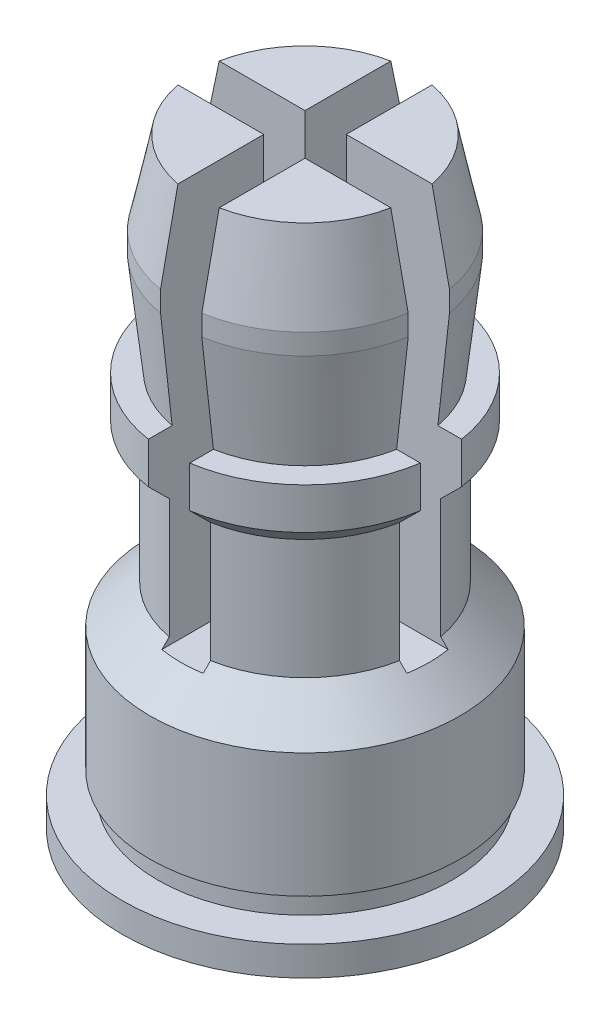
ISO-10303-21;
HEADER;
FILE_DESCRIPTION(('STEP AP214'),'2;1');
FILE_NAME('part.step','',(''),(''),'','','');
FILE_SCHEMA(('AUTOMOTIVE_DESIGN { 1 0 10303 214 1 1 1 1 }'));
ENDSEC;
DATA;
#1=APPLICATION_CONTEXT('core data for automotive mechanical design processes');
#2=APPLICATION_PROTOCOL_DEFINITION('international standard','automotive_design',2000,#1);
#3=PRODUCT_CONTEXT('',#1,'mechanical');
#4=PRODUCT('Part','Part','',(#3));
#5=PRODUCT_RELATED_PRODUCT_CATEGORY('part','',(#4));
#6=PRODUCT_DEFINITION_FORMATION('','',#4);
#7=PRODUCT_DEFINITION_CONTEXT('part definition',#1,'design');
#8=PRODUCT_DEFINITION('design','',#6,#7);
#9=PRODUCT_DEFINITION_SHAPE('','',#8);
#10=(LENGTH_UNIT() NAMED_UNIT(*) SI_UNIT(.MILLI.,.METRE.));
#11=(NAMED_UNIT(*) PLANE_ANGLE_UNIT() SI_UNIT($,.RADIAN.));
#12=(NAMED_UNIT(*) SI_UNIT($,.STERADIAN.) SOLID_ANGLE_UNIT());
#13=UNCERTAINTY_MEASURE_WITH_UNIT(LENGTH_MEASURE(1.E-05),#10,'distance_accuracy_value','');
#14=(GEOMETRIC_REPRESENTATION_CONTEXT(3) GLOBAL_UNCERTAINTY_ASSIGNED_CONTEXT((#13)) GLOBAL_UNIT_ASSIGNED_CONTEXT((#10,
#11,#12)) REPRESENTATION_CONTEXT('',''));
#15=CARTESIAN_POINT('',(0.,0.,0.));
#16=DIRECTION('',(0.,0.,1.));
#17=DIRECTION('',(1.,0.,0.));
#18=AXIS2_PLACEMENT_3D('',#15,#16,#17);
#19=CARTESIAN_POINT('',(0.,5.78357999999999,0.));
#20=DIRECTION('',(0.,1.,0.));
#21=DIRECTION('',(0.,0.,1.));
#22=AXIS2_PLACEMENT_3D('',#19,#20,#21);
#23=CONICAL_SURFACE('',#22,2.02946,0.78539816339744);
#24=CARTESIAN_POINT('',(0.358140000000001,4.20373685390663,0.271829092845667));
#25=CARTESIAN_POINT('',(0.358140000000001,4.21524318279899,0.290820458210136));
#26=CARTESIAN_POINT('',(0.358140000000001,4.22726502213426,0.309483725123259));
#27=CARTESIAN_POINT('',(0.358140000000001,4.25209024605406,0.346266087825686));
#28=CARTESIAN_POINT('',(0.358140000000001,4.26489306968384,0.364385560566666));
#29=CARTESIAN_POINT('',(0.358140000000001,4.29102496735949,0.4001876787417));
#30=CARTESIAN_POINT('',(0.358140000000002,4.30435308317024,0.417871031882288));
#31=CARTESIAN_POINT('',(0.358140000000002,4.33142353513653,0.452922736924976));
#32=CARTESIAN_POINT('',(0.358140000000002,4.34516595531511,0.470291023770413));
#33=CARTESIAN_POINT('',(0.358140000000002,4.3867973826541,0.521953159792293));
#34=CARTESIAN_POINT('',(0.358140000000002,4.41514476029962,0.555876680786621));
#35=CARTESIAN_POINT('',(0.358140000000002,4.47260220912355,0.62309848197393));
#36=CARTESIAN_POINT('',(0.358140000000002,4.5017127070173,0.656396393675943));
#37=CARTESIAN_POINT('',(0.358140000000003,4.5872321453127,0.752780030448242));
#38=CARTESIAN_POINT('',(0.358140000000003,4.64428680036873,0.815291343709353));
#39=CARTESIAN_POINT('',(0.358140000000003,4.75929020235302,0.939486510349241));
#40=CARTESIAN_POINT('',(0.358140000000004,4.81723902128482,1.00117029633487));
#41=CARTESIAN_POINT('',(0.358140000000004,4.93366161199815,1.1240284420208));
#42=CARTESIAN_POINT('',(0.358140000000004,4.99213532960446,1.18520285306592));
#43=CARTESIAN_POINT('',(0.358140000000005,5.10941832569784,1.30722942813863));
#44=CARTESIAN_POINT('',(0.358140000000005,5.16822760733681,1.36808158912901));
#45=CARTESIAN_POINT('',(0.358140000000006,5.34533480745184,1.55067522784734));
#46=CARTESIAN_POINT('',(0.358140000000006,5.46396670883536,1.67209255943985));
#47=CARTESIAN_POINT('',(0.358140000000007,5.70167388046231,1.9144826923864));
#48=CARTESIAN_POINT('',(0.358140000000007,5.82074913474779,2.03545550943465));
#49=CARTESIAN_POINT('',(0.358140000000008,6.0901423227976,2.30854170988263));
#50=CARTESIAN_POINT('',(0.358140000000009,6.24053811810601,2.46057828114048));
#51=CARTESIAN_POINT('',(0.35814000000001,6.5415676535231,2.76441962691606));
#52=CARTESIAN_POINT('',(0.35814000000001,6.69220139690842,2.91622439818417));
#53=CARTESIAN_POINT('',(0.358140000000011,6.99298299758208,3.2190494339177));
#54=CARTESIAN_POINT('',(0.358140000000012,7.14313023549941,3.37007031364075));
#55=CARTESIAN_POINT('',(0.358140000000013,7.4435233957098,3.67200910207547));
#56=CARTESIAN_POINT('',(0.358140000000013,7.59376931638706,3.82292701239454));
#57=CARTESIAN_POINT('',(0.358140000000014,7.74404311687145,3.97381708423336));
#58=B_SPLINE_CURVE_WITH_KNOTS('',3,(#24,#25,#26,#27,#28,#29,#30,#31,#32,#33,#34,#35,#36,#37,#38,
#39,#40,#41,#42,#43,#44,#45,#46,#47,#48,#49,#50,#51,#52,#53,#54,#55,#56,#57),.UNSPECIFIED.,.F.,
.F.,(4,2,2,2,2,2,2,2,2,2,2,2,2,2,2,2,4),(0.,0.0665877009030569,0.133128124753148,
0.199552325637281,0.265990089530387,0.398594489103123,0.531274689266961,0.785154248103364,
1.03905435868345,1.29292855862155,1.54680514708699,2.05605774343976,2.56529218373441,
3.20685695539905,3.84843064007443,4.48730731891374,5.12617378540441),.UNSPECIFIED.);
#59=CARTESIAN_POINT('',(0.358140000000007,5.78357999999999,1.99760947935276));
#60=VERTEX_POINT('',#59);
#61=CARTESIAN_POINT('',(0.358140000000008,6.14172,2.36058668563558));
#62=VERTEX_POINT('',#61);
#63=EDGE_CURVE('E566',#60,#62,#58,.T.);
#64=ORIENTED_EDGE('',*,*,#63,.F.);
#65=CARTESIAN_POINT('',(0.,5.78357999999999,0.));
#66=DIRECTION('',(0.,-1.,0.));
#67=DIRECTION('',(0.,0.,-1.));
#68=AXIS2_PLACEMENT_3D('',#65,#66,#67);
#69=CIRCLE('',#68,2.02946);
#70=CARTESIAN_POINT('',(1.99760947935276,5.78357999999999,0.35814));
#71=VERTEX_POINT('',#70);
#72=EDGE_CURVE('E356',#71,#60,#69,.T.);
#73=ORIENTED_EDGE('',*,*,#72,.F.);
#74=CARTESIAN_POINT('',(5.24876251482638,9.01508684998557,0.35814));
#75=CARTESIAN_POINT('',(5.06735767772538,8.83410632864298,0.35814));
#76=CARTESIAN_POINT('',(4.88593436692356,8.65314430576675,0.35814));
#77=CARTESIAN_POINT('',(4.52302234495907,8.29127730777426,0.35814));
#78=CARTESIAN_POINT('',(4.3415336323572,8.11037233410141,0.35814));
#79=CARTESIAN_POINT('',(3.97837328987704,7.74855076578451,0.35814));
#80=CARTESIAN_POINT('',(3.79670161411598,7.56763421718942,0.35814));
#81=CARTESIAN_POINT('',(3.43323304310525,7.20593524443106,0.35814));
#82=CARTESIAN_POINT('',(3.25143615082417,7.02515281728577,0.35814));
#83=CARTESIAN_POINT('',(2.88692590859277,6.66309897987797,0.35814));
#84=CARTESIAN_POINT('',(2.70421173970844,6.48182839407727,0.35814));
#85=CARTESIAN_POINT('',(2.3384039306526,6.11964533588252,0.35814));
#86=CARTESIAN_POINT('',(2.15531026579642,5.93873288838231,0.35814));
#87=CARTESIAN_POINT('',(1.88012294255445,5.66798150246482,0.35814));
#88=CARTESIAN_POINT('',(1.78831826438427,5.57784910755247,0.35814));
#89=CARTESIAN_POINT('',(1.60439932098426,5.39789570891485,0.35814));
#90=CARTESIAN_POINT('',(1.51228504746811,5.30807471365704,0.35814));
#91=CARTESIAN_POINT('',(1.32756811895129,5.12895736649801,0.35814));
#92=CARTESIAN_POINT('',(1.23496552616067,5.0396609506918,0.35814));
#93=CARTESIAN_POINT('',(1.09535709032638,4.90645814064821,0.35814));
#94=CARTESIAN_POINT('',(1.04870454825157,4.86218179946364,0.35814));
#95=CARTESIAN_POINT('',(0.955055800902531,4.77399442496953,0.35814));
#96=CARTESIAN_POINT('',(0.908059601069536,4.73008338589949,0.35814));
#97=CARTESIAN_POINT('',(0.835088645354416,4.66271285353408,0.35814));
#98=CARTESIAN_POINT('',(0.809297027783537,4.63905519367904,0.35814));
#99=CARTESIAN_POINT('',(0.757513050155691,4.59195898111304,0.35814));
#100=CARTESIAN_POINT('',(0.731520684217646,4.56852043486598,0.35814));
#101=CARTESIAN_POINT('',(0.679254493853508,4.52191539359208,0.35814));
#102=CARTESIAN_POINT('',(0.652980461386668,4.49874913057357,0.35814));
#103=CARTESIAN_POINT('',(0.600080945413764,4.45282725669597,0.35814));
#104=CARTESIAN_POINT('',(0.573455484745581,4.43007161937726,0.35814));
#105=CARTESIAN_POINT('',(0.503385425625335,4.37143916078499,0.35814));
#106=CARTESIAN_POINT('',(0.459562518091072,4.33600151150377,0.35814));
#107=CARTESIAN_POINT('',(0.392174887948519,4.28502109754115,0.35814));
#108=CARTESIAN_POINT('',(0.369438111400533,4.26839116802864,0.35814));
#109=CARTESIAN_POINT('',(0.323197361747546,4.23624279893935,0.35814));
#110=CARTESIAN_POINT('',(0.299693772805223,4.22072381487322,0.35814));
#111=CARTESIAN_POINT('',(0.251562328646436,4.19136369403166,0.35814));
#112=CARTESIAN_POINT('',(0.226931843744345,4.17752678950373,0.35814));
#113=CARTESIAN_POINT('',(0.176259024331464,4.15267422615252,0.35814));
#114=CARTESIAN_POINT('',(0.150218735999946,4.14165460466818,0.35814));
#115=CARTESIAN_POINT('',(0.102593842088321,4.12614921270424,0.35814));
#116=CARTESIAN_POINT('',(0.0813181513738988,4.12075269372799,0.35814));
#117=CARTESIAN_POINT('',(0.038183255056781,4.11366744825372,0.35814));
#118=CARTESIAN_POINT('',(0.0163259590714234,4.11196781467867,0.35814));
#119=CARTESIAN_POINT('',(-0.0273757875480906,4.11263740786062,0.35814));
#120=CARTESIAN_POINT('',(-0.0492200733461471,4.11501668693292,0.35814));
#121=CARTESIAN_POINT('',(-0.0922322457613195,4.12333684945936,0.35814));
#122=CARTESIAN_POINT('',(-0.113398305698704,4.1292866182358,0.35814));
#123=CARTESIAN_POINT('',(-0.157609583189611,4.14478281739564,0.35814));
#124=CARTESIAN_POINT('',(-0.180515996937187,4.1547098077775,0.35814));
#125=CARTESIAN_POINT('',(-0.225262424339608,4.17676354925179,0.35814));
#126=CARTESIAN_POINT('',(-0.247100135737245,4.18889480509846,0.35814));
#127=CARTESIAN_POINT('',(-0.290100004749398,4.21468926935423,0.35814));
#128=CARTESIAN_POINT('',(-0.311254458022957,4.2283651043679,0.35814));
#129=CARTESIAN_POINT('',(-0.352877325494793,4.25666968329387,0.35814));
#130=CARTESIAN_POINT('',(-0.373346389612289,4.27129748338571,0.35814));
#131=CARTESIAN_POINT('',(-0.438110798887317,4.31917945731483,0.35814));
#132=CARTESIAN_POINT('',(-0.481471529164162,4.35368821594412,0.35814));
#133=CARTESIAN_POINT('',(-0.566913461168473,4.42426362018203,0.35814));
#134=CARTESIAN_POINT('',(-0.60899389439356,4.46033117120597,0.35814));
#135=CARTESIAN_POINT('',(-0.692434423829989,4.53342984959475,0.35814));
#136=CARTESIAN_POINT('',(-0.733793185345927,4.57046249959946,0.35814));
#137=CARTESIAN_POINT('',(-0.815987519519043,4.64507866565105,0.35814));
#138=CARTESIAN_POINT('',(-0.856823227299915,4.6826620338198,0.35814));
#139=CARTESIAN_POINT('',(-0.978446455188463,4.79561192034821,0.35814));
#140=CARTESIAN_POINT('',(-1.05873086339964,4.87151934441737,0.35814));
#141=CARTESIAN_POINT('',(-1.21853371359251,5.02397660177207,0.35814));
#142=CARTESIAN_POINT('',(-1.29805282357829,5.10052573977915,0.35814));
#143=CARTESIAN_POINT('',(-1.45888456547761,5.25618058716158,0.35814));
#144=CARTESIAN_POINT('',(-1.5401856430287,5.33529823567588,0.35814));
#145=CARTESIAN_POINT('',(-1.70251662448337,5.49381138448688,0.35814));
#146=CARTESIAN_POINT('',(-1.78354652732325,5.57320688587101,0.35814));
#147=CARTESIAN_POINT('',(-2.02637263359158,5.81166714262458,0.35814));
#148=CARTESIAN_POINT('',(-2.18790251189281,5.97100300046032,0.35814));
#149=CARTESIAN_POINT('',(-2.51068604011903,6.29010891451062,0.35814));
#150=CARTESIAN_POINT('',(-2.67193951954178,6.44987914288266,0.35814));
#151=CARTESIAN_POINT('',(-2.9942353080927,6.7696299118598,0.35814));
#152=CARTESIAN_POINT('',(-3.15527761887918,6.92961045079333,0.35814));
#153=CARTESIAN_POINT('',(-3.47750909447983,7.24997998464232,0.35814));
#154=CARTESIAN_POINT('',(-3.63869803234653,7.41036920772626,0.35814));
#155=CARTESIAN_POINT('',(-3.9609877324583,7.73123707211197,0.35814));
#156=CARTESIAN_POINT('',(-4.1220884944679,7.89171571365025,0.35814));
#157=CARTESIAN_POINT('',(-4.44414392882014,8.21265102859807,0.35814));
#158=CARTESIAN_POINT('',(-4.60509863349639,8.37310766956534,0.35814));
#159=CARTESIAN_POINT('',(-4.92696147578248,8.6940667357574,0.35814));
#160=CARTESIAN_POINT('',(-5.08786961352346,8.85456916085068,0.35814));
#161=CARTESIAN_POINT('',(-5.24876251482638,9.01508684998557,0.35814));
#162=B_SPLINE_CURVE_WITH_KNOTS('',3,(#74,#75,#76,#77,#78,#79,#80,#81,#82,#83,#84,#85,#86,#87,
#88,#89,#90,#91,#92,#93,#94,#95,#96,#97,#98,#99,#100,#101,#102,#103,#104,#105,#106,#107,#108,
#109,#110,#111,#112,#113,#114,#115,#116,#117,#118,#119,#120,#121,#122,#123,#124,#125,#126,#127,
#128,#129,#130,#131,#132,#133,#134,#135,#136,#137,#138,#139,#140,#141,#142,#143,#144,#145,#146,
#147,#148,#149,#150,#151,#152,#153,#154,#155,#156,#157,#158,#159,#160,#161),.UNSPECIFIED.,.F.,
.F.,(4,2,2,2,2,2,2,2,2,2,2,2,2,2,2,2,2,2,2,2,2,2,2,2,2,2,2,2,2,2,2,2,2,2,2,2,2,2,2,2,2,2,2,4),
(0.,0.768735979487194,1.53749005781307,2.30665747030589,3.07580723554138,3.84794142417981,
4.62012752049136,5.00609008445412,5.39206306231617,5.77798800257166,5.97094203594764,
6.16389302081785,6.26888738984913,6.37388484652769,6.47896608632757,6.58404053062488,
6.7530356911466,6.83752386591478,6.92197034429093,7.0066250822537,7.09116008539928,
7.15675467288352,7.22215546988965,7.28771767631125,7.35344371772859,7.42815714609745,
7.50302501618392,7.57855654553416,7.65401429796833,7.82017232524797,7.98642819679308,
8.15296448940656,8.31945685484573,8.65090815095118,8.98203763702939,9.32236731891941,
9.66269833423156,10.3433717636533,11.0243730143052,11.7053688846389,12.387541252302,
13.069715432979,13.7515326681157,14.433347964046),.UNSPECIFIED.);
#163=CARTESIAN_POINT('',(2.36058668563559,6.14172,0.35814));
#164=VERTEX_POINT('',#163);
#165=EDGE_CURVE('E685',#164,#71,#162,.T.);
#166=ORIENTED_EDGE('',*,*,#165,.F.);
#167=CARTESIAN_POINT('',(0.,6.14172,0.));
#168=DIRECTION('',(0.,-1.,0.));
#169=DIRECTION('',(0.,0.,-1.));
#170=AXIS2_PLACEMENT_3D('',#167,#168,#169);
#171=CIRCLE('',#170,2.3876);
#172=EDGE_CURVE('E654',#164,#62,#171,.T.);
#173=ORIENTED_EDGE('',*,*,#172,.T.);
#174=EDGE_LOOP('',(#64,#73,#166,#173));
#175=FACE_BOUND('',#174,.T.);
#176=ADVANCED_FACE('F33',(#175),#23,.T.);
#177=CARTESIAN_POINT('',(0.,0.,0.));
#178=DIRECTION('',(0.,-1.,0.));
#179=DIRECTION('',(0.,0.,-1.));
#180=AXIS2_PLACEMENT_3D('',#177,#178,#179);
#181=CYLINDRICAL_SURFACE('',#180,2.02946);
#182=DIRECTION('',(0.,-1.,0.));
#183=VECTOR('',#182,1.);
#184=CARTESIAN_POINT('',(0.358140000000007,0.,1.99760947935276));
#185=LINE('',#184,#183);
#186=CARTESIAN_POINT('',(0.358140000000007,3.706368,1.99760947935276));
#187=VERTEX_POINT('',#186);
#188=EDGE_CURVE('E1192',#187,#60,#185,.F.);
#189=ORIENTED_EDGE('',*,*,#188,.F.);
#190=CARTESIAN_POINT('',(0.,3.706368,0.));
#191=DIRECTION('',(0.,-1.,0.));
#192=DIRECTION('',(0.,0.,-1.));
#193=AXIS2_PLACEMENT_3D('',#190,#191,#192);
#194=CIRCLE('',#193,2.02946);
#195=CARTESIAN_POINT('',(1.99760947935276,3.706368,0.35814));
#196=VERTEX_POINT('',#195);
#197=EDGE_CURVE('E350',#196,#187,#194,.T.);
#198=ORIENTED_EDGE('',*,*,#197,.F.);
#199=DIRECTION('',(0.,-1.,0.));
#200=VECTOR('',#199,1.);
#201=CARTESIAN_POINT('',(1.99760947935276,0.,0.35814));
#202=LINE('',#201,#200);
#203=EDGE_CURVE('E682',#71,#196,#202,.T.);
#204=ORIENTED_EDGE('',*,*,#203,.F.);
#205=ORIENTED_EDGE('',*,*,#72,.T.);
#206=EDGE_LOOP('',(#189,#198,#204,#205));
#207=FACE_BOUND('',#206,.T.);
#208=ADVANCED_FACE('F723',(#207),#181,.T.);
#209=CARTESIAN_POINT('',(1.88214,10.4394,0.));
#210=DIRECTION('',(0.,1.,0.));
#211=DIRECTION('',(0.,0.,1.));
#212=AXIS2_PLACEMENT_3D('',#209,#210,#211);
#213=PLANE('',#212);
#214=DIRECTION('',(0.,0.,-1.));
#215=VECTOR('',#214,1.);
#216=CARTESIAN_POINT('',(0.358139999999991,10.4394,-2.66847400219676));
#217=LINE('',#216,#215);
#218=CARTESIAN_POINT('',(0.358140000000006,10.4394,1.84775180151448));
#219=VERTEX_POINT('',#218);
#220=CARTESIAN_POINT('',(0.358140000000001,10.4394,0.358139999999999));
#221=VERTEX_POINT('',#220);
#222=EDGE_CURVE('E1156',#219,#221,#217,.T.);
#223=ORIENTED_EDGE('',*,*,#222,.F.);
#224=CARTESIAN_POINT('',(0.,10.4394,0.));
#225=DIRECTION('',(0.,-1.,0.));
#226=DIRECTION('',(0.,0.,-1.));
#227=AXIS2_PLACEMENT_3D('',#224,#225,#226);
#228=CIRCLE('',#227,1.88214);
#229=CARTESIAN_POINT('',(1.84775180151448,10.4394,0.35814));
#230=VERTEX_POINT('',#229);
#231=EDGE_CURVE('E316',#230,#219,#228,.T.);
#232=ORIENTED_EDGE('',*,*,#231,.F.);
#233=DIRECTION('',(1.,0.,0.));
#234=VECTOR('',#233,1.);
#235=CARTESIAN_POINT('',(2.66847400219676,10.4394,0.35814));
#236=LINE('',#235,#234);
#237=EDGE_CURVE('E1116',#221,#230,#236,.T.);
#238=ORIENTED_EDGE('',*,*,#237,.F.);
#239=EDGE_LOOP('',(#223,#232,#238));
#240=FACE_BOUND('',#239,.T.);
#241=ADVANCED_FACE('F729',(#240),#213,.T.);
#242=CARTESIAN_POINT('',(0.,9.00684,0.));
#243=DIRECTION('',(0.,-1.,0.));
#244=DIRECTION('',(0.,0.,-1.));
#245=AXIS2_PLACEMENT_3D('',#242,#243,#244);
#246=CONICAL_SURFACE('',#245,2.17932,0.204545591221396);
#247=CARTESIAN_POINT('',(0.35814000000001,5.97335840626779,2.78567834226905));
#248=CARTESIAN_POINT('',(0.358140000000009,6.54282121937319,2.66655620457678));
#249=CARTESIAN_POINT('',(0.358140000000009,7.11226548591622,2.54734496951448));
#250=CARTESIAN_POINT('',(0.358140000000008,8.25107619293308,2.30855532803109));
#251=CARTESIAN_POINT('',(0.358140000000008,8.82044263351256,2.18897692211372));
#252=CARTESIAN_POINT('',(0.358140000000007,9.95905924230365,1.94926348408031));
#253=CARTESIAN_POINT('',(0.358140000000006,10.5283094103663,1.8291284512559));
#254=CARTESIAN_POINT('',(0.358140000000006,11.3820267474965,1.64817838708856));
#255=CARTESIAN_POINT('',(0.358140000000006,11.666573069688,1.58773707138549));
#256=CARTESIAN_POINT('',(0.358140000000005,12.2355880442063,1.46648916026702));
#257=CARTESIAN_POINT('',(0.358140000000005,12.520056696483,1.40568256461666));
#258=CARTESIAN_POINT('',(0.358140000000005,12.8044738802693,1.34463530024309));
#259=B_SPLINE_CURVE_WITH_KNOTS('',3,(#247,#248,#249,#250,#251,#252,#253,#254,#255,#256,#257,
#258),.UNSPECIFIED.,.F.,.F.,(4,2,2,2,2,4),(0.,1.74536592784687,3.49072946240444,
5.23609521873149,6.10877929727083,6.98146393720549),.UNSPECIFIED.);
#260=CARTESIAN_POINT('',(0.358140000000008,9.00684,2.14969100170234));
#261=VERTEX_POINT('',#260);
#262=EDGE_CURVE('E581',#261,#219,#259,.T.);
#263=ORIENTED_EDGE('',*,*,#262,.F.);
#264=CARTESIAN_POINT('',(0.,9.00684,0.));
#265=DIRECTION('',(0.,-1.,0.));
#266=DIRECTION('',(0.,0.,-1.));
#267=AXIS2_PLACEMENT_3D('',#264,#265,#266);
#268=CIRCLE('',#267,2.17932);
#269=CARTESIAN_POINT('',(2.14969100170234,9.00684,0.35814));
#270=VERTEX_POINT('',#269);
#271=EDGE_CURVE('E317',#270,#261,#268,.T.);
#272=ORIENTED_EDGE('',*,*,#271,.F.);
#273=CARTESIAN_POINT('',(1.28664866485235,13.0741804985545,0.35814));
#274=CARTESIAN_POINT('',(1.36451078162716,12.7124368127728,0.35814));
#275=CARTESIAN_POINT('',(1.44195440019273,12.3506035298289,0.35814));
#276=CARTESIAN_POINT('',(1.59623559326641,11.6268081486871,0.35814));
#277=CARTESIAN_POINT('',(1.67307316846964,11.2648460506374,0.35814));
#278=CARTESIAN_POINT('',(1.82775337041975,10.5343253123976,0.35814));
#279=CARTESIAN_POINT('',(1.90558918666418,10.1657652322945,0.35814));
#280=CARTESIAN_POINT('',(2.09846779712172,9.25081303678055,0.35814));
#281=CARTESIAN_POINT('',(2.2133493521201,8.70438694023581,0.35814));
#282=CARTESIAN_POINT('',(2.44272855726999,7.61145470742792,0.35814));
#283=CARTESIAN_POINT('',(2.55722620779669,7.06494857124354,0.35814));
#284=CARTESIAN_POINT('',(2.67163597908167,6.518424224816,0.35814));
#285=B_SPLINE_CURVE_WITH_KNOTS('',3,(#273,#274,#275,#276,#277,#278,#279,#280,#281,#282,#283,
#284),.UNSPECIFIED.,.F.,.F.,(4,2,2,2,2,4),(0.,1.11008423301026,2.22016719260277,
3.35023546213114,5.02535115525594,6.70046521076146),.UNSPECIFIED.);
#286=EDGE_CURVE('E605',#230,#270,#285,.T.);
#287=ORIENTED_EDGE('',*,*,#286,.F.);
#288=ORIENTED_EDGE('',*,*,#231,.T.);
#289=EDGE_LOOP('',(#263,#272,#287,#288));
#290=FACE_BOUND('',#289,.T.);
#291=ADVANCED_FACE('F591',(#290),#246,.T.);
#292=CARTESIAN_POINT('',(0.,0.,0.));
#293=DIRECTION('',(0.,-1.,0.));
#294=DIRECTION('',(0.,0.,-1.));
#295=AXIS2_PLACEMENT_3D('',#292,#293,#294);
#296=CYLINDRICAL_SURFACE('',#295,2.17932);
#297=DIRECTION('',(0.,-1.,0.));
#298=VECTOR('',#297,1.);
#299=CARTESIAN_POINT('',(0.358140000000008,0.,2.14969100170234));
#300=LINE('',#299,#298);
#301=CARTESIAN_POINT('',(0.358140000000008,8.6487,2.14969100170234));
#302=VERTEX_POINT('',#301);
#303=EDGE_CURVE('E579',#302,#261,#300,.F.);
#304=ORIENTED_EDGE('',*,*,#303,.F.);
#305=CARTESIAN_POINT('',(0.,8.6487,0.));
#306=DIRECTION('',(0.,-1.,0.));
#307=DIRECTION('',(0.,0.,-1.));
#308=AXIS2_PLACEMENT_3D('',#305,#306,#307);
#309=CIRCLE('',#308,2.17932);
#310=CARTESIAN_POINT('',(2.14969100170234,8.6487,0.35814));
#311=VERTEX_POINT('',#310);
#312=EDGE_CURVE('E1083',#311,#302,#309,.T.);
#313=ORIENTED_EDGE('',*,*,#312,.F.);
#314=DIRECTION('',(0.,-1.,0.));
#315=VECTOR('',#314,1.);
#316=CARTESIAN_POINT('',(2.14969100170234,0.,0.35814));
#317=LINE('',#316,#315);
#318=EDGE_CURVE('E1186',#270,#311,#317,.T.);
#319=ORIENTED_EDGE('',*,*,#318,.F.);
#320=ORIENTED_EDGE('',*,*,#271,.T.);
#321=EDGE_LOOP('',(#304,#313,#319,#320));
#322=FACE_BOUND('',#321,.T.);
#323=ADVANCED_FACE('F784',(#322),#296,.T.);
#324=CARTESIAN_POINT('',(0.,6.858,0.));
#325=DIRECTION('',(0.,1.,0.));
#326=DIRECTION('',(0.,0.,1.));
#327=AXIS2_PLACEMENT_3D('',#324,#325,#326);
#328=CONICAL_SURFACE('',#327,1.9812,0.110190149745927);
#329=CARTESIAN_POINT('',(0.358140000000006,3.48823454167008,1.56799410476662));
#330=CARTESIAN_POINT('',(0.358140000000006,4.44809641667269,1.67689370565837));
#331=CARTESIAN_POINT('',(0.358140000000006,5.40801223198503,1.78531578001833));
#332=CARTESIAN_POINT('',(0.358140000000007,6.60510341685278,1.92011239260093));
#333=CARTESIAN_POINT('',(0.358140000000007,6.84224407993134,1.94679497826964));
#334=CARTESIAN_POINT('',(0.358140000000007,8.27649931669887,2.10806564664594));
#335=CARTESIAN_POINT('',(0.358140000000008,9.47366284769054,2.24221873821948));
#336=CARTESIAN_POINT('',(0.358140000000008,10.6708444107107,2.37620890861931));
#337=B_SPLINE_CURVE_WITH_KNOTS('',3,(#329,#330,#331,#332,#333,#334,#335,#336),.UNSPECIFIED.,.F.,
.F.,(4,2,2,4),(0.,2.89805847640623,3.61396970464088,7.22793913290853),.UNSPECIFIED.);
#338=CARTESIAN_POINT('',(0.358140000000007,6.858,1.94856079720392));
#339=VERTEX_POINT('',#338);
#340=EDGE_CURVE('E572',#339,#302,#337,.T.);
#341=ORIENTED_EDGE('',*,*,#340,.F.);
#342=CARTESIAN_POINT('',(0.,6.858,0.));
#343=DIRECTION('',(0.,-1.,0.));
#344=DIRECTION('',(0.,0.,-1.));
#345=AXIS2_PLACEMENT_3D('',#342,#343,#344);
#346=CIRCLE('',#345,1.9812);
#347=CARTESIAN_POINT('',(1.94856079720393,6.858,0.35814));
#348=VERTEX_POINT('',#347);
#349=EDGE_CURVE('E1095',#348,#339,#346,.T.);
#350=ORIENTED_EDGE('',*,*,#349,.F.);
#351=CARTESIAN_POINT('',(2.40108025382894,10.893158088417,0.35814));
#352=CARTESIAN_POINT('',(2.33343243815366,10.2884370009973,0.35814));
#353=CARTESIAN_POINT('',(2.26572780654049,9.68372225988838,0.35814));
#354=CARTESIAN_POINT('',(2.13015696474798,8.47431097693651,0.35814));
#355=CARTESIAN_POINT('',(2.06229075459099,7.86961443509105,0.35814));
#356=CARTESIAN_POINT('',(1.92634878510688,6.66024484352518,0.35814));
#357=CARTESIAN_POINT('',(1.85827302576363,6.05557179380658,0.35814));
#358=CARTESIAN_POINT('',(1.72182107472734,4.84625951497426,0.35814));
#359=CARTESIAN_POINT('',(1.65344488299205,4.24162028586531,0.35814));
#360=CARTESIAN_POINT('',(1.58487304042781,3.63700319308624,0.35814));
#361=B_SPLINE_CURVE_WITH_KNOTS('',3,(#351,#352,#353,#354,#355,#356,#357,#358,#359,#360),
.UNSPECIFIED.,.F.,.F.,(4,2,2,2,4),(0.,1.82547923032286,3.6509582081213,5.47643732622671,
7.30191670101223),.UNSPECIFIED.);
#362=EDGE_CURVE('E403',#311,#348,#361,.T.);
#363=ORIENTED_EDGE('',*,*,#362,.F.);
#364=ORIENTED_EDGE('',*,*,#312,.T.);
#365=EDGE_LOOP('',(#341,#350,#363,#364));
#366=FACE_BOUND('',#365,.T.);
#367=ADVANCED_FACE('F478',(#366),#328,.T.);
#368=CARTESIAN_POINT('',(2.3876,6.858,0.));
#369=DIRECTION('',(0.,1.,0.));
#370=DIRECTION('',(0.,0.,1.));
#371=AXIS2_PLACEMENT_3D('',#368,#369,#370);
#372=PLANE('',#371);
#373=DIRECTION('',(0.,0.,-1.));
#374=VECTOR('',#373,1.);
#375=CARTESIAN_POINT('',(0.35814,6.858,0.));
#376=LINE('',#375,#374);
#377=CARTESIAN_POINT('',(0.358140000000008,6.858,2.36058668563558));
#378=VERTEX_POINT('',#377);
#379=EDGE_CURVE('E580',#378,#339,#376,.T.);
#380=ORIENTED_EDGE('',*,*,#379,.F.);
#381=CARTESIAN_POINT('',(0.,6.858,0.));
#382=DIRECTION('',(0.,-1.,0.));
#383=DIRECTION('',(0.,0.,-1.));
#384=AXIS2_PLACEMENT_3D('',#381,#382,#383);
#385=CIRCLE('',#384,2.3876);
#386=CARTESIAN_POINT('',(2.36058668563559,6.858,0.35814));
#387=VERTEX_POINT('',#386);
#388=EDGE_CURVE('E656',#387,#378,#385,.T.);
#389=ORIENTED_EDGE('',*,*,#388,.F.);
#390=DIRECTION('',(1.,0.,0.));
#391=VECTOR('',#390,1.);
#392=CARTESIAN_POINT('',(2.3876,6.858,0.35814));
#393=LINE('',#392,#391);
#394=EDGE_CURVE('E399',#348,#387,#393,.T.);
#395=ORIENTED_EDGE('',*,*,#394,.F.);
#396=ORIENTED_EDGE('',*,*,#349,.T.);
#397=EDGE_LOOP('',(#380,#389,#395,#396));
#398=FACE_BOUND('',#397,.T.);
#399=ADVANCED_FACE('F768',(#398),#372,.T.);
#400=CARTESIAN_POINT('',(0.,0.,0.));
#401=DIRECTION('',(0.,-1.,0.));
#402=DIRECTION('',(0.,0.,-1.));
#403=AXIS2_PLACEMENT_3D('',#400,#401,#402);
#404=CYLINDRICAL_SURFACE('',#403,2.3876);
#405=DIRECTION('',(0.,-1.,0.));
#406=VECTOR('',#405,1.);
#407=CARTESIAN_POINT('',(0.358140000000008,0.,2.36058668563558));
#408=LINE('',#407,#406);
#409=EDGE_CURVE('E1191',#62,#378,#408,.F.);
#410=ORIENTED_EDGE('',*,*,#409,.F.);
#411=ORIENTED_EDGE('',*,*,#172,.F.);
#412=DIRECTION('',(0.,-1.,0.));
#413=VECTOR('',#412,1.);
#414=CARTESIAN_POINT('',(2.36058668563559,0.,0.35814));
#415=LINE('',#414,#413);
#416=EDGE_CURVE('E362',#387,#164,#415,.T.);
#417=ORIENTED_EDGE('',*,*,#416,.F.);
#418=ORIENTED_EDGE('',*,*,#388,.T.);
#419=EDGE_LOOP('',(#410,#411,#417,#418));
#420=FACE_BOUND('',#419,.T.);
#421=ADVANCED_FACE('F720',(#420),#404,.T.);
#422=CARTESIAN_POINT('',(0.358139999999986,7.74404311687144,-3.97381708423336));
#423=CARTESIAN_POINT('',(0.358139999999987,7.59341485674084,-3.82257100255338));
#424=CARTESIAN_POINT('',(0.358139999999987,7.44281454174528,-3.67129701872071));
#425=CARTESIAN_POINT('',(0.358139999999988,7.14173473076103,-3.36866717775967));
#426=CARTESIAN_POINT('',(0.358139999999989,6.99125522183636,-3.21731133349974));
#427=CARTESIAN_POINT('',(0.35813999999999,6.69049614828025,-2.91450614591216));
#428=CARTESIAN_POINT('',(0.35813999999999,6.54021653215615,-2.76305685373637));
#429=CARTESIAN_POINT('',(0.358139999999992,6.23987363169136,-2.45990658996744));
#430=CARTESIAN_POINT('',(0.358139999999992,6.08981037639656,-2.30820558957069));
#431=CARTESIAN_POINT('',(0.358139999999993,5.86497568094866,-2.08028815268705));
#432=CARTESIAN_POINT('',(0.358139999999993,5.79004692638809,-2.00422693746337));
#433=CARTESIAN_POINT('',(0.358139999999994,5.64034174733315,-1.85196200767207));
#434=CARTESIAN_POINT('',(0.358139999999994,5.56556531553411,-1.77575830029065));
#435=CARTESIAN_POINT('',(0.358139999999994,5.41625585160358,-1.62316933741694));
#436=CARTESIAN_POINT('',(0.358139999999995,5.34172273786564,-1.54678416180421));
#437=CARTESIAN_POINT('',(0.358139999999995,5.19296866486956,-1.3936836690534));
#438=CARTESIAN_POINT('',(0.358139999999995,5.11874776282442,-1.31696829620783));
#439=CARTESIAN_POINT('',(0.358139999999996,5.00777256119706,-1.20145442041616));
#440=CARTESIAN_POINT('',(0.358139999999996,4.97081576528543,-1.16285054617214));
#441=CARTESIAN_POINT('',(0.358139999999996,4.89708644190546,-1.08547075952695));
#442=CARTESIAN_POINT('',(0.358139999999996,4.86031390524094,-1.04669485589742));
#443=CARTESIAN_POINT('',(0.358139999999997,4.78703891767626,-0.968930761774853));
#444=CARTESIAN_POINT('',(0.358139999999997,4.75053632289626,-0.929942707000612));
#445=CARTESIAN_POINT('',(0.358139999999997,4.67787666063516,-0.851631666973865));
#446=CARTESIAN_POINT('',(0.358139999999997,4.64171965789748,-0.812308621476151));
#447=CARTESIAN_POINT('',(0.358139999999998,4.5698569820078,-0.733103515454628));
#448=CARTESIAN_POINT('',(0.358139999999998,4.53415239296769,-0.69322046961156));
#449=CARTESIAN_POINT('',(0.358139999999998,4.46358502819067,-0.612744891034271));
#450=CARTESIAN_POINT('',(0.358139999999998,4.42872183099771,-0.572152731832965));
#451=CARTESIAN_POINT('',(0.358139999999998,4.37746389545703,-0.510317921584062));
#452=CARTESIAN_POINT('',(0.358139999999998,4.36053100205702,-0.489522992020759));
#453=CARTESIAN_POINT('',(0.358139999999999,4.32717435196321,-0.447537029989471));
#454=CARTESIAN_POINT('',(0.358139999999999,4.31075045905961,-0.426346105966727));
#455=CARTESIAN_POINT('',(0.358139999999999,4.27857085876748,-0.383394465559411));
#456=CARTESIAN_POINT('',(0.358139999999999,4.26281642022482,-0.361632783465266));
#457=CARTESIAN_POINT('',(0.358139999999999,4.23237506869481,-0.317348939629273));
#458=CARTESIAN_POINT('',(0.358139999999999,4.21768918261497,-0.294826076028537));
#459=CARTESIAN_POINT('',(0.358139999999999,4.20373685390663,-0.271829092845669));
#460=B_SPLINE_CURVE_WITH_KNOTS('',3,(#422,#423,#424,#425,#426,#427,#428,#429,#430,#431,#432,
#433,#434,#435,#436,#437,#438,#439,#440,#441,#442,#443,#444,#445,#446,#447,#448,#449,#450,#451,
#452,#453,#454,#455,#456,#457,#458,#459),.UNSPECIFIED.,.F.,.F.,(4,2,2,2,2,2,2,2,2,2,2,2,2,2,2,2,
2,2,4),(0.,0.640373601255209,1.28066571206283,1.9207340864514,2.56088160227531,2.88118857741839,
3.20147981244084,3.52164948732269,3.84187547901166,4.00220152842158,4.16251949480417,
4.3227447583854,4.48299947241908,4.64358456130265,4.80408746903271,4.88453252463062,
4.96495586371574,5.04552539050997,5.12617135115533),.UNSPECIFIED.);
#461=CARTESIAN_POINT('',(0.358139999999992,6.14172,-2.36058668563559));
#462=VERTEX_POINT('',#461);
#463=CARTESIAN_POINT('',(0.358139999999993,5.78357999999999,-1.99760947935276));
#464=VERTEX_POINT('',#463);
#465=EDGE_CURVE('E551',#462,#464,#460,.T.);
#466=ORIENTED_EDGE('',*,*,#465,.F.);
#467=CARTESIAN_POINT('',(2.36058668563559,6.14172,-0.35814));
#468=VERTEX_POINT('',#467);
#469=EDGE_CURVE('E650',#462,#468,#171,.T.);
#470=ORIENTED_EDGE('',*,*,#469,.T.);
#471=CARTESIAN_POINT('',(-5.24876251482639,9.01508684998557,-0.35814));
#472=CARTESIAN_POINT('',(-5.06735767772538,8.83410632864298,-0.35814));
#473=CARTESIAN_POINT('',(-4.88593436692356,8.65314430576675,-0.35814));
#474=CARTESIAN_POINT('',(-4.52302234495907,8.29127730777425,-0.35814));
#475=CARTESIAN_POINT('',(-4.3415336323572,8.11037233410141,-0.35814));
#476=CARTESIAN_POINT('',(-3.97837328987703,7.7485507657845,-0.35814));
#477=CARTESIAN_POINT('',(-3.79670161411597,7.56763421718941,-0.35814));
#478=CARTESIAN_POINT('',(-3.43323304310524,7.20593524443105,-0.35814));
#479=CARTESIAN_POINT('',(-3.25143615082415,7.02515281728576,-0.35814));
#480=CARTESIAN_POINT('',(-2.88692590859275,6.66309897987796,-0.35814));
#481=CARTESIAN_POINT('',(-2.70421173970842,6.48182839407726,-0.35814));
#482=CARTESIAN_POINT('',(-2.33840393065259,6.11964533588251,-0.35814));
#483=CARTESIAN_POINT('',(-2.15531026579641,5.93873288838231,-0.35814));
#484=CARTESIAN_POINT('',(-1.88012294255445,5.66798150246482,-0.35814));
#485=CARTESIAN_POINT('',(-1.78831826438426,5.57784910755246,-0.35814));
#486=CARTESIAN_POINT('',(-1.60439932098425,5.39789570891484,-0.35814));
#487=CARTESIAN_POINT('',(-1.51228504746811,5.30807471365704,-0.35814));
#488=CARTESIAN_POINT('',(-1.32756811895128,5.12895736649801,-0.35814));
#489=CARTESIAN_POINT('',(-1.23496552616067,5.0396609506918,-0.35814));
#490=CARTESIAN_POINT('',(-1.09535709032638,4.90645814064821,-0.35814));
#491=CARTESIAN_POINT('',(-1.04870454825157,4.86218179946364,-0.35814));
#492=CARTESIAN_POINT('',(-0.95505580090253,4.77399442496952,-0.35814));
#493=CARTESIAN_POINT('',(-0.908059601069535,4.73008338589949,-0.35814));
#494=CARTESIAN_POINT('',(-0.835088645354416,4.66271285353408,-0.35814));
#495=CARTESIAN_POINT('',(-0.809297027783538,4.63905519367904,-0.35814));
#496=CARTESIAN_POINT('',(-0.757513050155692,4.59195898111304,-0.35814));
#497=CARTESIAN_POINT('',(-0.731520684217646,4.56852043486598,-0.35814));
#498=CARTESIAN_POINT('',(-0.679254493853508,4.52191539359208,-0.35814));
#499=CARTESIAN_POINT('',(-0.652980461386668,4.49874913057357,-0.35814));
#500=CARTESIAN_POINT('',(-0.600080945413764,4.45282725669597,-0.35814));
#501=CARTESIAN_POINT('',(-0.573455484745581,4.43007161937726,-0.35814));
#502=CARTESIAN_POINT('',(-0.503385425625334,4.37143916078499,-0.35814));
#503=CARTESIAN_POINT('',(-0.459562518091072,4.33600151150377,-0.35814));
#504=CARTESIAN_POINT('',(-0.392174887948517,4.28502109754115,-0.35814));
#505=CARTESIAN_POINT('',(-0.369438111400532,4.26839116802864,-0.35814));
#506=CARTESIAN_POINT('',(-0.323197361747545,4.23624279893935,-0.35814));
#507=CARTESIAN_POINT('',(-0.299693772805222,4.22072381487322,-0.35814));
#508=CARTESIAN_POINT('',(-0.251562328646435,4.19136369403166,-0.35814));
#509=CARTESIAN_POINT('',(-0.226931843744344,4.17752678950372,-0.35814));
#510=CARTESIAN_POINT('',(-0.176259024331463,4.15267422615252,-0.35814));
#511=CARTESIAN_POINT('',(-0.150218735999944,4.14165460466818,-0.35814));
#512=CARTESIAN_POINT('',(-0.10259384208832,4.12614921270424,-0.35814));
#513=CARTESIAN_POINT('',(-0.0813181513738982,4.12075269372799,-0.35814));
#514=CARTESIAN_POINT('',(-0.0381832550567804,4.11366744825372,-0.35814));
#515=CARTESIAN_POINT('',(-0.0163259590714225,4.11196781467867,-0.35814));
#516=CARTESIAN_POINT('',(0.0273757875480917,4.11263740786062,-0.35814));
#517=CARTESIAN_POINT('',(0.0492200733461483,4.11501668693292,-0.35814));
#518=CARTESIAN_POINT('',(0.0922322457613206,4.12333684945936,-0.35814));
#519=CARTESIAN_POINT('',(0.113398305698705,4.1292866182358,-0.35814));
#520=CARTESIAN_POINT('',(0.157609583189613,4.14478281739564,-0.35814));
#521=CARTESIAN_POINT('',(0.180515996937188,4.1547098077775,-0.35814));
#522=CARTESIAN_POINT('',(0.22526242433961,4.17676354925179,-0.35814));
#523=CARTESIAN_POINT('',(0.247100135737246,4.18889480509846,-0.35814));
#524=CARTESIAN_POINT('',(0.2901000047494,4.21468926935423,-0.35814));
#525=CARTESIAN_POINT('',(0.311254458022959,4.2283651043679,-0.35814));
#526=CARTESIAN_POINT('',(0.352877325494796,4.25666968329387,-0.35814));
#527=CARTESIAN_POINT('',(0.373346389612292,4.27129748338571,-0.35814));
#528=CARTESIAN_POINT('',(0.438110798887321,4.31917945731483,-0.35814));
#529=CARTESIAN_POINT('',(0.481471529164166,4.35368821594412,-0.35814));
#530=CARTESIAN_POINT('',(0.566913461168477,4.42426362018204,-0.35814));
#531=CARTESIAN_POINT('',(0.608993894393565,4.46033117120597,-0.35814));
#532=CARTESIAN_POINT('',(0.692434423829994,4.53342984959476,-0.35814));
#533=CARTESIAN_POINT('',(0.733793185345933,4.57046249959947,-0.35814));
#534=CARTESIAN_POINT('',(0.81598751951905,4.64507866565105,-0.35814));
#535=CARTESIAN_POINT('',(0.856823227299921,4.68266203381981,-0.35814));
#536=CARTESIAN_POINT('',(0.978446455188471,4.79561192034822,-0.35814));
#537=CARTESIAN_POINT('',(1.05873086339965,4.87151934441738,-0.35814));
#538=CARTESIAN_POINT('',(1.21853371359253,5.02397660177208,-0.35814));
#539=CARTESIAN_POINT('',(1.2980528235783,5.10052573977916,-0.35814));
#540=CARTESIAN_POINT('',(1.45888456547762,5.2561805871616,-0.35814));
#541=CARTESIAN_POINT('',(1.54018564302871,5.33529823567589,-0.35814));
#542=CARTESIAN_POINT('',(1.70251662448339,5.49381138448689,-0.35814));
#543=CARTESIAN_POINT('',(1.78354652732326,5.57320688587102,-0.35814));
#544=CARTESIAN_POINT('',(2.0263726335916,5.81166714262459,-0.35814));
#545=CARTESIAN_POINT('',(2.18790251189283,5.97100300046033,-0.35814));
#546=CARTESIAN_POINT('',(2.51068604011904,6.29010891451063,-0.35814));
#547=CARTESIAN_POINT('',(2.67193951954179,6.44987914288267,-0.35814));
#548=CARTESIAN_POINT('',(2.99423530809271,6.76962991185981,-0.35814));
#549=CARTESIAN_POINT('',(3.15527761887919,6.92961045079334,-0.35814));
#550=CARTESIAN_POINT('',(3.47750909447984,7.24997998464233,-0.35814));
#551=CARTESIAN_POINT('',(3.63869803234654,7.41036920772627,-0.35814));
#552=CARTESIAN_POINT('',(3.96098773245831,7.73123707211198,-0.35814));
#553=CARTESIAN_POINT('',(4.12208849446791,7.89171571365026,-0.35814));
#554=CARTESIAN_POINT('',(4.44414392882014,8.21265102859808,-0.35814));
#555=CARTESIAN_POINT('',(4.6050986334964,8.37310766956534,-0.35814));
#556=CARTESIAN_POINT('',(4.92696147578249,8.6940667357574,-0.35814));
#557=CARTESIAN_POINT('',(5.08786961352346,8.85456916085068,-0.35814));
#558=CARTESIAN_POINT('',(5.24876251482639,9.01508684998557,-0.35814));
#559=B_SPLINE_CURVE_WITH_KNOTS('',3,(#471,#472,#473,#474,#475,#476,#477,#478,#479,#480,#481,
#482,#483,#484,#485,#486,#487,#488,#489,#490,#491,#492,#493,#494,#495,#496,#497,#498,#499,#500,
#501,#502,#503,#504,#505,#506,#507,#508,#509,#510,#511,#512,#513,#514,#515,#516,#517,#518,#519,
#520,#521,#522,#523,#524,#525,#526,#527,#528,#529,#530,#531,#532,#533,#534,#535,#536,#537,#538,
#539,#540,#541,#542,#543,#544,#545,#546,#547,#548,#549,#550,#551,#552,#553,#554,#555,#556,#557,
#558),.UNSPECIFIED.,.F.,.F.,(4,2,2,2,2,2,2,2,2,2,2,2,2,2,2,2,2,2,2,2,2,2,2,2,2,2,2,2,2,2,2,2,2,
2,2,2,2,2,2,2,2,2,2,4),(0.,0.768735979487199,1.53749005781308,2.30665747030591,3.0758072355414,
3.84794142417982,4.62012752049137,5.00609008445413,5.39206306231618,5.77798800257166,
5.97094203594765,6.16389302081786,6.26888738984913,6.37388484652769,6.47896608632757,
6.58404053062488,6.75303569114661,6.83752386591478,6.92197034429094,7.0066250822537,
7.09116008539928,7.15675467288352,7.22215546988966,7.28771767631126,7.35344371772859,
7.42815714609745,7.50302501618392,7.57855654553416,7.65401429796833,7.82017232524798,
7.98642819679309,8.15296448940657,8.31945685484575,8.6509081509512,8.98203763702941,
9.32236731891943,9.66269833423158,10.3433717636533,11.0243730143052,11.7053688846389,
12.387541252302,13.069715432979,13.7515326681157,14.433347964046),.UNSPECIFIED.);
#560=CARTESIAN_POINT('',(1.99760947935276,5.78357999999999,-0.35814));
#561=VERTEX_POINT('',#560);
#562=EDGE_CURVE('E406',#561,#468,#559,.T.);
#563=ORIENTED_EDGE('',*,*,#562,.F.);
#564=EDGE_CURVE('E355',#464,#561,#69,.T.);
#565=ORIENTED_EDGE('',*,*,#564,.F.);
#566=EDGE_LOOP('',(#466,#470,#563,#565));
#567=FACE_BOUND('',#566,.T.);
#568=ADVANCED_FACE('F725',(#567),#23,.T.);
#569=DIRECTION('',(0.,-1.,0.));
#570=VECTOR('',#569,1.);
#571=CARTESIAN_POINT('',(0.358139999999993,0.,-1.99760947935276));
#572=LINE('',#571,#570);
#573=CARTESIAN_POINT('',(0.358139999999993,3.706368,-1.99760947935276));
#574=VERTEX_POINT('',#573);
#575=EDGE_CURVE('E1111',#464,#574,#572,.T.);
#576=ORIENTED_EDGE('',*,*,#575,.F.);
#577=ORIENTED_EDGE('',*,*,#564,.T.);
#578=DIRECTION('',(0.,-1.,0.));
#579=VECTOR('',#578,1.);
#580=CARTESIAN_POINT('',(1.99760947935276,0.,-0.35814));
#581=LINE('',#580,#579);
#582=CARTESIAN_POINT('',(1.99760947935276,3.706368,-0.35814));
#583=VERTEX_POINT('',#582);
#584=EDGE_CURVE('E400',#583,#561,#581,.F.);
#585=ORIENTED_EDGE('',*,*,#584,.F.);
#586=EDGE_CURVE('E345',#574,#583,#194,.T.);
#587=ORIENTED_EDGE('',*,*,#586,.F.);
#588=EDGE_LOOP('',(#576,#577,#585,#587));
#589=FACE_BOUND('',#588,.T.);
#590=ADVANCED_FACE('F731',(#589),#181,.T.);
#591=CARTESIAN_POINT('',(0.358139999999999,10.4394,-0.358140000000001));
#592=VERTEX_POINT('',#591);
#593=CARTESIAN_POINT('',(0.358139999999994,10.4394,-1.84775180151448));
#594=VERTEX_POINT('',#593);
#595=EDGE_CURVE('E307',#592,#594,#217,.T.);
#596=ORIENTED_EDGE('',*,*,#595,.F.);
#597=DIRECTION('',(-1.,0.,0.));
#598=VECTOR('',#597,1.);
#599=CARTESIAN_POINT('',(-2.66847400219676,10.4394,-0.35814));
#600=LINE('',#599,#598);
#601=CARTESIAN_POINT('',(1.84775180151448,10.4394,-0.35814));
#602=VERTEX_POINT('',#601);
#603=EDGE_CURVE('E1115',#602,#592,#600,.T.);
#604=ORIENTED_EDGE('',*,*,#603,.F.);
#605=EDGE_CURVE('E314',#594,#602,#228,.T.);
#606=ORIENTED_EDGE('',*,*,#605,.F.);
#607=EDGE_LOOP('',(#596,#604,#606));
#608=FACE_BOUND('',#607,.T.);
#609=ADVANCED_FACE('F790',(#608),#213,.T.);
#610=CARTESIAN_POINT('',(0.358139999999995,12.8044738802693,-1.34463530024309));
#611=CARTESIAN_POINT('',(0.358139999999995,12.4275261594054,-1.4255265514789));
#612=CARTESIAN_POINT('',(0.358139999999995,12.0504932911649,-1.50601907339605));
#613=CARTESIAN_POINT('',(0.358139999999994,11.2963049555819,-1.66642618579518));
#614=CARTESIAN_POINT('',(0.358139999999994,10.9191494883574,-1.7463407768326));
#615=CARTESIAN_POINT('',(0.358139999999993,10.1579228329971,-1.907257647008));
#616=CARTESIAN_POINT('',(0.358139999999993,9.77385026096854,-1.98825337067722));
#617=CARTESIAN_POINT('',(0.358139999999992,8.82044272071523,-2.18898022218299));
#618=CARTESIAN_POINT('',(0.358139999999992,8.25107530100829,-2.30855717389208));
#619=CARTESIAN_POINT('',(0.358139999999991,7.11226388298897,-2.54734364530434));
#620=CARTESIAN_POINT('',(0.358139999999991,6.54281988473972,-2.66655316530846));
#621=CARTESIAN_POINT('',(0.35813999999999,5.97335840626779,-2.78567834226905));
#622=B_SPLINE_CURVE_WITH_KNOTS('',3,(#610,#611,#612,#613,#614,#615,#616,#617,#618,#619,#620,
#621),.UNSPECIFIED.,.F.,.F.,(4,2,2,2,2,4),(0.,1.15658764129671,2.31317417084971,
3.49073445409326,5.23609990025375,6.98146391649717),.UNSPECIFIED.);
#623=CARTESIAN_POINT('',(0.358139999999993,9.00684,-2.14969100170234));
#624=VERTEX_POINT('',#623);
#625=EDGE_CURVE('E544',#594,#624,#622,.T.);
#626=ORIENTED_EDGE('',*,*,#625,.F.);
#627=ORIENTED_EDGE('',*,*,#605,.T.);
#628=CARTESIAN_POINT('',(2.67163597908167,6.518424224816,-0.35814));
#629=CARTESIAN_POINT('',(2.55722939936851,7.06495003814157,-0.35814));
#630=CARTESIAN_POINT('',(2.44272992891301,7.61145650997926,-0.35814));
#631=CARTESIAN_POINT('',(2.21334738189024,8.70438798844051,-0.35814));
#632=CARTESIAN_POINT('',(2.09846430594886,9.25081299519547,-0.35814));
#633=CARTESIAN_POINT('',(1.86811617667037,10.3435413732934,-0.35814));
#634=CARTESIAN_POINT('',(1.75265112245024,10.8898447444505,-0.35814));
#635=CARTESIAN_POINT('',(1.57867074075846,11.7091341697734,-0.35814));
#636=CARTESIAN_POINT('',(1.52054676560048,11.9822032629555,-0.35814));
#637=CARTESIAN_POINT('',(1.40391564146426,12.5282597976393,-0.35814));
#638=CARTESIAN_POINT('',(1.34540849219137,12.801247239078,-0.35814));
#639=CARTESIAN_POINT('',(1.28664866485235,13.0741804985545,-0.35814));
#640=B_SPLINE_CURVE_WITH_KNOTS('',3,(#628,#629,#630,#631,#632,#633,#634,#635,#636,#637,#638,
#639),.UNSPECIFIED.,.F.,.F.,(4,2,2,2,2,4),(0.,1.67511624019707,3.35022974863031,
5.02534579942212,5.86290519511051,6.70046523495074),.UNSPECIFIED.);
#641=CARTESIAN_POINT('',(2.14969100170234,9.00684,-0.35814));
#642=VERTEX_POINT('',#641);
#643=EDGE_CURVE('E598',#642,#602,#640,.T.);
#644=ORIENTED_EDGE('',*,*,#643,.F.);
#645=EDGE_CURVE('E1080',#624,#642,#268,.T.);
#646=ORIENTED_EDGE('',*,*,#645,.F.);
#647=EDGE_LOOP('',(#626,#627,#644,#646));
#648=FACE_BOUND('',#647,.T.);
#649=ADVANCED_FACE('F781',(#648),#246,.T.);
#650=DIRECTION('',(0.,-1.,0.));
#651=VECTOR('',#650,1.);
#652=CARTESIAN_POINT('',(0.358139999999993,0.,-2.14969100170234));
#653=LINE('',#652,#651);
#654=CARTESIAN_POINT('',(0.358139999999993,8.6487,-2.14969100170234));
#655=VERTEX_POINT('',#654);
#656=EDGE_CURVE('E528',#624,#655,#653,.T.);
#657=ORIENTED_EDGE('',*,*,#656,.F.);
#658=ORIENTED_EDGE('',*,*,#645,.T.);
#659=DIRECTION('',(0.,-1.,0.));
#660=VECTOR('',#659,1.);
#661=CARTESIAN_POINT('',(2.14969100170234,0.,-0.35814));
#662=LINE('',#661,#660);
#663=CARTESIAN_POINT('',(2.14969100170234,8.6487,-0.35814));
#664=VERTEX_POINT('',#663);
#665=EDGE_CURVE('E470',#664,#642,#662,.F.);
#666=ORIENTED_EDGE('',*,*,#665,.F.);
#667=EDGE_CURVE('E1090',#655,#664,#309,.T.);
#668=ORIENTED_EDGE('',*,*,#667,.F.);
#669=EDGE_LOOP('',(#657,#658,#666,#668));
#670=FACE_BOUND('',#669,.T.);
#671=ADVANCED_FACE('F774',(#670),#296,.T.);
#672=CARTESIAN_POINT('',(0.358139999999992,10.6708444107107,-2.37620890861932));
#673=CARTESIAN_POINT('',(0.358139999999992,10.0722515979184,-2.30923125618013));
#674=CARTESIAN_POINT('',(0.358139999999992,9.47366520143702,-2.24219617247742));
#675=CARTESIAN_POINT('',(0.358139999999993,8.27651081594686,-2.10796263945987));
#676=CARTESIAN_POINT('',(0.358139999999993,7.67794282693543,-2.04076419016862));
#677=CARTESIAN_POINT('',(0.358139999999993,6.48083061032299,-1.90615539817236));
#678=CARTESIAN_POINT('',(0.358139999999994,5.8822863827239,-1.83874505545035));
#679=CARTESIAN_POINT('',(0.358139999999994,4.68523214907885,-1.70362048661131));
#680=CARTESIAN_POINT('',(0.358139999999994,4.08672214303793,-1.6359062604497));
#681=CARTESIAN_POINT('',(0.358139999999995,3.48823454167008,-1.56799410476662));
#682=B_SPLINE_CURVE_WITH_KNOTS('',3,(#672,#673,#674,#675,#676,#677,#678,#679,#680,#681),
.UNSPECIFIED.,.F.,.F.,(4,2,2,2,4),(0.,1.80698486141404,3.61396946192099,5.42095420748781,
7.22793921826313),.UNSPECIFIED.);
#683=CARTESIAN_POINT('',(0.358139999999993,6.858,-1.94856079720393));
#684=VERTEX_POINT('',#683);
#685=EDGE_CURVE('E520',#655,#684,#682,.T.);
#686=ORIENTED_EDGE('',*,*,#685,.F.);
#687=ORIENTED_EDGE('',*,*,#667,.T.);
#688=CARTESIAN_POINT('',(1.58487304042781,3.63700319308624,-0.35814));
#689=CARTESIAN_POINT('',(1.69483074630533,4.60669431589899,-0.35814));
#690=CARTESIAN_POINT('',(1.80431638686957,5.57643873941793,-0.35814));
#691=CARTESIAN_POINT('',(1.94044407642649,6.7857875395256,-0.35814));
#692=CARTESIAN_POINT('',(1.96739070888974,7.02535761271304,-0.35814));
#693=CARTESIAN_POINT('',(2.13025883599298,8.47429960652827,-0.35814));
#694=CARTESIAN_POINT('',(2.26575019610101,9.68371992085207,-0.35814));
#695=CARTESIAN_POINT('',(2.40108025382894,10.893158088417,-0.35814));
#696=B_SPLINE_CURVE_WITH_KNOTS('',3,(#688,#689,#690,#691,#692,#693,#694,#695),.UNSPECIFIED.,.F.,
.F.,(4,2,2,4),(0.,2.9277161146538,3.65095844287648,7.30191661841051),.UNSPECIFIED.);
#697=CARTESIAN_POINT('',(1.94856079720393,6.858,-0.35814));
#698=VERTEX_POINT('',#697);
#699=EDGE_CURVE('E424',#698,#664,#696,.T.);
#700=ORIENTED_EDGE('',*,*,#699,.F.);
#701=EDGE_CURVE('E665',#684,#698,#346,.T.);
#702=ORIENTED_EDGE('',*,*,#701,.F.);
#703=EDGE_LOOP('',(#686,#687,#700,#702));
#704=FACE_BOUND('',#703,.T.);
#705=ADVANCED_FACE('F767',(#704),#328,.T.);
#706=DIRECTION('',(0.,0.,-1.));
#707=VECTOR('',#706,1.);
#708=CARTESIAN_POINT('',(0.35814,6.858,0.));
#709=LINE('',#708,#707);
#710=CARTESIAN_POINT('',(0.358139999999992,6.858,-2.36058668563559));
#711=VERTEX_POINT('',#710);
#712=EDGE_CURVE('E529',#684,#711,#709,.T.);
#713=ORIENTED_EDGE('',*,*,#712,.F.);
#714=ORIENTED_EDGE('',*,*,#701,.T.);
#715=DIRECTION('',(-1.,0.,0.));
#716=VECTOR('',#715,1.);
#717=CARTESIAN_POINT('',(2.3876,6.858,-0.35814));
#718=LINE('',#717,#716);
#719=CARTESIAN_POINT('',(2.36058668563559,6.858,-0.35814));
#720=VERTEX_POINT('',#719);
#721=EDGE_CURVE('E417',#720,#698,#718,.T.);
#722=ORIENTED_EDGE('',*,*,#721,.F.);
#723=EDGE_CURVE('E649',#711,#720,#385,.T.);
#724=ORIENTED_EDGE('',*,*,#723,.F.);
#725=EDGE_LOOP('',(#713,#714,#722,#724));
#726=FACE_BOUND('',#725,.T.);
#727=ADVANCED_FACE('F652',(#726),#372,.T.);
#728=DIRECTION('',(0.,-1.,0.));
#729=VECTOR('',#728,1.);
#730=CARTESIAN_POINT('',(0.358139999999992,0.,-2.36058668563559));
#731=LINE('',#730,#729);
#732=EDGE_CURVE('E636',#711,#462,#731,.T.);
#733=ORIENTED_EDGE('',*,*,#732,.F.);
#734=ORIENTED_EDGE('',*,*,#723,.T.);
#735=DIRECTION('',(0.,-1.,0.));
#736=VECTOR('',#735,1.);
#737=CARTESIAN_POINT('',(2.36058668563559,0.,-0.35814));
#738=LINE('',#737,#736);
#739=EDGE_CURVE('E359',#468,#720,#738,.F.);
#740=ORIENTED_EDGE('',*,*,#739,.F.);
#741=ORIENTED_EDGE('',*,*,#469,.F.);
#742=EDGE_LOOP('',(#733,#734,#740,#741));
#743=FACE_BOUND('',#742,.T.);
#744=ADVANCED_FACE('F647',(#743),#404,.T.);
#745=CARTESIAN_POINT('',(2.66847400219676,3.579368,0.35814));
#746=DIRECTION('',(0.,0.,1.));
#747=DIRECTION('',(1.,0.,0.));
#748=AXIS2_PLACEMENT_3D('',#745,#746,#747);
#749=PLANE('',#748);
#750=DIRECTION('',(1.,0.,0.));
#751=VECTOR('',#750,1.);
#752=CARTESIAN_POINT('',(2.66847400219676,3.579368,0.35814));
#753=LINE('',#752,#751);
#754=CARTESIAN_POINT('',(0.358140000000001,3.579368,0.35814));
#755=VERTEX_POINT('',#754);
#756=CARTESIAN_POINT('',(2.12651251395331,3.579368,0.35814));
#757=VERTEX_POINT('',#756);
#758=EDGE_CURVE('E378',#755,#757,#753,.T.);
#759=ORIENTED_EDGE('',*,*,#758,.F.);
#760=DIRECTION('',(0.,1.,0.));
#761=VECTOR('',#760,1.);
#762=CARTESIAN_POINT('',(0.358140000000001,3.579368,0.35814));
#763=LINE('',#762,#761);
#764=EDGE_CURVE('E634',#755,#221,#763,.T.);
#765=ORIENTED_EDGE('',*,*,#764,.T.);
#766=ORIENTED_EDGE('',*,*,#237,.T.);
#767=ORIENTED_EDGE('',*,*,#286,.T.);
#768=ORIENTED_EDGE('',*,*,#318,.T.);
#769=ORIENTED_EDGE('',*,*,#362,.T.);
#770=ORIENTED_EDGE('',*,*,#394,.T.);
#771=ORIENTED_EDGE('',*,*,#416,.T.);
#772=ORIENTED_EDGE('',*,*,#165,.T.);
#773=ORIENTED_EDGE('',*,*,#203,.T.);
#774=CARTESIAN_POINT('',(-5.34775638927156,0.376092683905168,0.35814));
#775=CARTESIAN_POINT('',(-5.16327575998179,0.560157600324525,0.35814));
#776=CARTESIAN_POINT('',(-4.97877704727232,0.744204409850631,0.35814));
#777=CARTESIAN_POINT('',(-4.60971584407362,1.11224212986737,0.35814));
#778=CARTESIAN_POINT('',(-4.42515335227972,1.29623303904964,0.35814));
#779=CARTESIAN_POINT('',(-4.05585344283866,1.66422249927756,0.35814));
#780=CARTESIAN_POINT('',(-3.87111598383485,1.84822100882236,0.35814));
#781=CARTESIAN_POINT('',(-3.50151873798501,2.21608730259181,0.35814));
#782=CARTESIAN_POINT('',(-3.31665895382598,2.39995508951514,0.35814));
#783=CARTESIAN_POINT('',(-2.94536123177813,2.76884807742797,0.35814));
#784=CARTESIAN_POINT('',(-2.75892176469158,2.95387173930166,0.35814));
#785=CARTESIAN_POINT('',(-2.38567081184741,3.32356730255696,0.35814));
#786=CARTESIAN_POINT('',(-2.19885930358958,3.50823918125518,0.35814));
#787=CARTESIAN_POINT('',(-1.91810382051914,3.78464233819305,0.35814));
#788=CARTESIAN_POINT('',(-1.82444362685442,3.87666162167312,0.35814));
#789=CARTESIAN_POINT('',(-1.63681913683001,4.06039440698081,0.35814));
#790=CARTESIAN_POINT('',(-1.54285483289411,4.15210790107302,0.35814));
#791=CARTESIAN_POINT('',(-1.35444573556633,4.33502005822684,0.35814));
#792=CARTESIAN_POINT('',(-1.26000099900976,4.42621877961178,0.35814));
#793=CARTESIAN_POINT('',(-1.117640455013,4.56228814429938,0.35814));
#794=CARTESIAN_POINT('',(-1.07007234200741,4.60752223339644,0.35814));
#795=CARTESIAN_POINT('',(-0.974597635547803,4.69763143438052,0.35814));
#796=CARTESIAN_POINT('',(-0.926691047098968,4.74250655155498,0.35814));
#797=CARTESIAN_POINT('',(-0.852355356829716,4.81134027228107,0.35814));
#798=CARTESIAN_POINT('',(-0.826107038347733,4.83549393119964,0.35814));
#799=CARTESIAN_POINT('',(-0.773413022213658,4.88358640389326,0.35814));
#800=CARTESIAN_POINT('',(-0.746967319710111,4.90752521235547,0.35814));
#801=CARTESIAN_POINT('',(-0.693811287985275,4.95512487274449,0.35814));
#802=CARTESIAN_POINT('',(-0.667100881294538,4.97878563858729,0.35814));
#803=CARTESIAN_POINT('',(-0.613334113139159,5.02570615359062,0.35814));
#804=CARTESIAN_POINT('',(-0.586277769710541,5.0489659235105,0.35814));
#805=CARTESIAN_POINT('',(-0.516817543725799,5.1074710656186,0.35814));
#806=CARTESIAN_POINT('',(-0.47408720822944,5.14233839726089,0.35814));
#807=CARTESIAN_POINT('',(-0.408506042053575,5.19273416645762,0.35814));
#808=CARTESIAN_POINT('',(-0.386393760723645,5.20921812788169,0.35814));
#809=CARTESIAN_POINT('',(-0.341489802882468,5.241227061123,0.35814));
#810=CARTESIAN_POINT('',(-0.31869837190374,5.25675237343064,0.35814));
#811=CARTESIAN_POINT('',(-0.269779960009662,5.28788697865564,0.35814));
#812=CARTESIAN_POINT('',(-0.24355150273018,5.30333954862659,0.35814));
#813=CARTESIAN_POINT('',(-0.189527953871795,5.33128906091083,0.35814));
#814=CARTESIAN_POINT('',(-0.161735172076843,5.34379022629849,0.35814));
#815=CARTESIAN_POINT('',(-0.112113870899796,5.36105780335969,0.35814));
#816=CARTESIAN_POINT('',(-0.0907118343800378,5.36700241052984,0.35814));
#817=CARTESIAN_POINT('',(-0.0472437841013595,5.37520944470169,0.35814));
#818=CARTESIAN_POINT('',(-0.0251802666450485,5.37748428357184,0.35814));
#819=CARTESIAN_POINT('',(0.0190789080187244,5.37786573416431,0.35814));
#820=CARTESIAN_POINT('',(0.041274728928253,5.37595463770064,0.35814));
#821=CARTESIAN_POINT('',(0.0850324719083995,5.36837026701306,0.35814));
#822=CARTESIAN_POINT('',(0.106592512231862,5.36268680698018,0.35814));
#823=CARTESIAN_POINT('',(0.150091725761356,5.34808685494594,0.35814));
#824=CARTESIAN_POINT('',(0.171966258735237,5.33898610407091,0.35814));
#825=CARTESIAN_POINT('',(0.214728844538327,5.31867349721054,0.35814));
#826=CARTESIAN_POINT('',(0.235614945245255,5.30745766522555,0.35814));
#827=CARTESIAN_POINT('',(0.276733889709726,5.28354042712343,0.35814));
#828=CARTESIAN_POINT('',(0.296959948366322,5.2708275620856,0.35814));
#829=CARTESIAN_POINT('',(0.336751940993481,5.24445623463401,0.35814));
#830=CARTESIAN_POINT('',(0.356318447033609,5.23079862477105,0.35814));
#831=CARTESIAN_POINT('',(0.417805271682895,5.18631343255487,0.35814));
#832=CARTESIAN_POINT('',(0.458831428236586,5.15425937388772,0.35814));
#833=CARTESIAN_POINT('',(0.539622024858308,5.0885897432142,0.35814));
#834=CARTESIAN_POINT('',(0.579385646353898,5.05497319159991,0.35814));
#835=CARTESIAN_POINT('',(0.658193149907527,4.98676731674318,0.35814));
#836=CARTESIAN_POINT('',(0.697235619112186,4.95217636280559,0.35814));
#837=CARTESIAN_POINT('',(0.774792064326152,4.88243274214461,0.35814));
#838=CARTESIAN_POINT('',(0.813306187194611,4.84728023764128,0.35814));
#839=CARTESIAN_POINT('',(0.928080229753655,4.74149198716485,0.35814));
#840=CARTESIAN_POINT('',(1.00382643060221,4.67029985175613,0.35814));
#841=CARTESIAN_POINT('',(1.1545315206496,4.52724840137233,0.35814));
#842=CARTESIAN_POINT('',(1.2294911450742,4.45538985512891,0.35814));
#843=CARTESIAN_POINT('',(1.37866007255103,4.3115462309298,0.35814));
#844=CARTESIAN_POINT('',(1.45287122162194,4.23956306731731,0.35814));
#845=CARTESIAN_POINT('',(1.60102502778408,4.09532081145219,0.35814));
#846=CARTESIAN_POINT('',(1.67496768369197,4.0230617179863,0.35814));
#847=CARTESIAN_POINT('',(1.89653117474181,3.80600908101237,0.35814));
#848=CARTESIAN_POINT('',(2.04388477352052,3.66094285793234,0.35814));
#849=CARTESIAN_POINT('',(2.33829165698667,3.37038350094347,0.35814));
#850=CARTESIAN_POINT('',(2.48534478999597,3.22489021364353,0.35814));
#851=CARTESIAN_POINT('',(2.77923200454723,2.93368514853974,0.35814));
#852=CARTESIAN_POINT('',(2.92606608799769,2.78797337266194,0.35814));
#853=CARTESIAN_POINT('',(3.36638384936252,2.35062048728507,0.35814));
#854=CARTESIAN_POINT('',(3.65966705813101,2.05877763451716,0.35814));
#855=CARTESIAN_POINT('',(4.24595626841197,1.47487249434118,0.35814));
#856=CARTESIAN_POINT('',(4.5389622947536,1.1828102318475,0.35814));
#857=CARTESIAN_POINT('',(4.9178871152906,0.804921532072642,0.35814));
#858=CARTESIAN_POINT('',(5.00387105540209,0.719160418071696,0.35814));
#859=CARTESIAN_POINT('',(5.17582365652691,0.547631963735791,0.35814));
#860=CARTESIAN_POINT('',(5.26179231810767,0.461864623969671,0.35814));
#861=CARTESIAN_POINT('',(5.34775638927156,0.376092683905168,0.35814));
#862=B_SPLINE_CURVE_WITH_KNOTS('',3,(#774,#775,#776,#777,#778,#779,#780,#781,#782,#783,#784,
#785,#786,#787,#788,#789,#790,#791,#792,#793,#794,#795,#796,#797,#798,#799,#800,#801,#802,#803,
#804,#805,#806,#807,#808,#809,#810,#811,#812,#813,#814,#815,#816,#817,#818,#819,#820,#821,#822,
#823,#824,#825,#826,#827,#828,#829,#830,#831,#832,#833,#834,#835,#836,#837,#838,#839,#840,#841,
#842,#843,#844,#845,#846,#847,#848,#849,#850,#851,#852,#853,#854,#855,#856,#857,#858,#859,#860,
#861),.UNSPECIFIED.,.F.,.F.,(4,2,2,2,2,2,2,2,2,2,2,2,2,2,2,2,2,2,2,2,2,2,2,2,2,2,2,2,2,2,2,2,2,
2,2,2,2,2,2,2,2,2,2,4),(0.,0.78180367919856,1.56362442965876,2.3458330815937,3.1280250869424,
3.91602296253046,4.70407003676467,5.09797054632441,5.49188094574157,5.88574578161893,
6.082670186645,6.27959168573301,6.38660176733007,6.49361448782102,6.60065951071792,
6.7076989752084,6.87308664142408,6.95581147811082,7.03850676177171,7.12973729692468,
7.22083649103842,7.28723111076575,7.35340069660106,7.41985074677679,7.48648095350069,
7.55739210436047,7.62843790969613,7.7000680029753,7.77163427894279,7.92773056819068,
8.08392607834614,8.2404006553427,8.39683081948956,8.70867072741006,9.02018713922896,
9.33034672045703,9.6405076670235,10.260841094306,10.8814344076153,11.5020222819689,
12.7432654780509,13.9843843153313,14.348710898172,14.7130182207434),.UNSPECIFIED.);
#863=EDGE_CURVE('E680',#196,#757,#862,.T.);
#864=ORIENTED_EDGE('',*,*,#863,.T.);
#865=EDGE_LOOP('',(#759,#765,#766,#767,#768,#769,#770,#771,#772,#773,#864));
#866=FACE_BOUND('',#865,.T.);
#867=ADVANCED_FACE('F715',(#866),#749,.F.);
#868=CARTESIAN_POINT('',(-2.66847400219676,3.579368,-0.35814));
#869=DIRECTION('',(0.,0.,-1.));
#870=DIRECTION('',(-1.,0.,0.));
#871=AXIS2_PLACEMENT_3D('',#868,#869,#870);
#872=PLANE('',#871);
#873=ORIENTED_EDGE('',*,*,#603,.T.);
#874=DIRECTION('',(0.,-1.,0.));
#875=VECTOR('',#874,1.);
#876=CARTESIAN_POINT('',(0.358139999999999,3.579368,-0.35814));
#877=LINE('',#876,#875);
#878=CARTESIAN_POINT('',(0.358139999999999,3.579368,-0.358140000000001));
#879=VERTEX_POINT('',#878);
#880=EDGE_CURVE('E391',#592,#879,#877,.T.);
#881=ORIENTED_EDGE('',*,*,#880,.T.);
#882=DIRECTION('',(-1.,0.,0.));
#883=VECTOR('',#882,1.);
#884=CARTESIAN_POINT('',(-2.66847400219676,3.579368,-0.35814));
#885=LINE('',#884,#883);
#886=CARTESIAN_POINT('',(2.12651251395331,3.579368,-0.35814));
#887=VERTEX_POINT('',#886);
#888=EDGE_CURVE('E376',#887,#879,#885,.T.);
#889=ORIENTED_EDGE('',*,*,#888,.F.);
#890=CARTESIAN_POINT('',(5.34775638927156,0.376092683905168,-0.35814));
#891=CARTESIAN_POINT('',(5.16327575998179,0.560157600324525,-0.35814));
#892=CARTESIAN_POINT('',(4.97877704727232,0.744204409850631,-0.35814));
#893=CARTESIAN_POINT('',(4.60971584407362,1.11224212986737,-0.35814));
#894=CARTESIAN_POINT('',(4.42515335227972,1.29623303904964,-0.35814));
#895=CARTESIAN_POINT('',(4.05585344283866,1.66422249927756,-0.35814));
#896=CARTESIAN_POINT('',(3.87111598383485,1.84822100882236,-0.35814));
#897=CARTESIAN_POINT('',(3.50151873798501,2.21608730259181,-0.35814));
#898=CARTESIAN_POINT('',(3.31665895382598,2.39995508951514,-0.35814));
#899=CARTESIAN_POINT('',(2.94536123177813,2.76884807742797,-0.35814));
#900=CARTESIAN_POINT('',(2.75892176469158,2.95387173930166,-0.35814));
#901=CARTESIAN_POINT('',(2.38567081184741,3.32356730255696,-0.35814));
#902=CARTESIAN_POINT('',(2.19885930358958,3.50823918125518,-0.35814));
#903=CARTESIAN_POINT('',(1.91810382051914,3.78464233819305,-0.35814));
#904=CARTESIAN_POINT('',(1.82444362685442,3.87666162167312,-0.35814));
#905=CARTESIAN_POINT('',(1.63681913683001,4.06039440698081,-0.35814));
#906=CARTESIAN_POINT('',(1.54285483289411,4.15210790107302,-0.35814));
#907=CARTESIAN_POINT('',(1.35444573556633,4.33502005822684,-0.35814));
#908=CARTESIAN_POINT('',(1.26000099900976,4.42621877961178,-0.35814));
#909=CARTESIAN_POINT('',(1.117640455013,4.56228814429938,-0.35814));
#910=CARTESIAN_POINT('',(1.07007234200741,4.60752223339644,-0.35814));
#911=CARTESIAN_POINT('',(0.974597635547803,4.69763143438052,-0.35814));
#912=CARTESIAN_POINT('',(0.926691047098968,4.74250655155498,-0.35814));
#913=CARTESIAN_POINT('',(0.852355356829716,4.81134027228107,-0.35814));
#914=CARTESIAN_POINT('',(0.826107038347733,4.83549393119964,-0.35814));
#915=CARTESIAN_POINT('',(0.773413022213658,4.88358640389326,-0.35814));
#916=CARTESIAN_POINT('',(0.746967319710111,4.90752521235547,-0.35814));
#917=CARTESIAN_POINT('',(0.693811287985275,4.95512487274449,-0.35814));
#918=CARTESIAN_POINT('',(0.667100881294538,4.97878563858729,-0.35814));
#919=CARTESIAN_POINT('',(0.613334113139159,5.02570615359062,-0.35814));
#920=CARTESIAN_POINT('',(0.586277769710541,5.0489659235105,-0.35814));
#921=CARTESIAN_POINT('',(0.516817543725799,5.1074710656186,-0.35814));
#922=CARTESIAN_POINT('',(0.47408720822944,5.14233839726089,-0.35814));
#923=CARTESIAN_POINT('',(0.408506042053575,5.19273416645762,-0.35814));
#924=CARTESIAN_POINT('',(0.386393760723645,5.20921812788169,-0.35814));
#925=CARTESIAN_POINT('',(0.341489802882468,5.241227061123,-0.35814));
#926=CARTESIAN_POINT('',(0.31869837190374,5.25675237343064,-0.35814));
#927=CARTESIAN_POINT('',(0.269779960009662,5.28788697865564,-0.35814));
#928=CARTESIAN_POINT('',(0.24355150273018,5.30333954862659,-0.35814));
#929=CARTESIAN_POINT('',(0.189527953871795,5.33128906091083,-0.35814));
#930=CARTESIAN_POINT('',(0.161735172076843,5.34379022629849,-0.35814));
#931=CARTESIAN_POINT('',(0.112113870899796,5.36105780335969,-0.35814));
#932=CARTESIAN_POINT('',(0.0907118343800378,5.36700241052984,-0.35814));
#933=CARTESIAN_POINT('',(0.0472437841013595,5.37520944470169,-0.35814));
#934=CARTESIAN_POINT('',(0.0251802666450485,5.37748428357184,-0.35814));
#935=CARTESIAN_POINT('',(-0.0190789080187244,5.37786573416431,-0.35814));
#936=CARTESIAN_POINT('',(-0.041274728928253,5.37595463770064,-0.35814));
#937=CARTESIAN_POINT('',(-0.0850324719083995,5.36837026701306,-0.35814));
#938=CARTESIAN_POINT('',(-0.106592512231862,5.36268680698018,-0.35814));
#939=CARTESIAN_POINT('',(-0.150091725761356,5.34808685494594,-0.35814));
#940=CARTESIAN_POINT('',(-0.171966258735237,5.33898610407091,-0.35814));
#941=CARTESIAN_POINT('',(-0.214728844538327,5.31867349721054,-0.35814));
#942=CARTESIAN_POINT('',(-0.235614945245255,5.30745766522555,-0.35814));
#943=CARTESIAN_POINT('',(-0.276733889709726,5.28354042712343,-0.35814));
#944=CARTESIAN_POINT('',(-0.296959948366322,5.2708275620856,-0.35814));
#945=CARTESIAN_POINT('',(-0.336751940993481,5.24445623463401,-0.35814));
#946=CARTESIAN_POINT('',(-0.356318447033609,5.23079862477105,-0.35814));
#947=CARTESIAN_POINT('',(-0.417805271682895,5.18631343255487,-0.35814));
#948=CARTESIAN_POINT('',(-0.458831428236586,5.15425937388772,-0.35814));
#949=CARTESIAN_POINT('',(-0.539622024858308,5.0885897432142,-0.35814));
#950=CARTESIAN_POINT('',(-0.579385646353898,5.05497319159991,-0.35814));
#951=CARTESIAN_POINT('',(-0.658193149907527,4.98676731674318,-0.35814));
#952=CARTESIAN_POINT('',(-0.697235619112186,4.95217636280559,-0.35814));
#953=CARTESIAN_POINT('',(-0.774792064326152,4.88243274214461,-0.35814));
#954=CARTESIAN_POINT('',(-0.813306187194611,4.84728023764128,-0.35814));
#955=CARTESIAN_POINT('',(-0.928080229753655,4.74149198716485,-0.35814));
#956=CARTESIAN_POINT('',(-1.00382643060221,4.67029985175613,-0.35814));
#957=CARTESIAN_POINT('',(-1.1545315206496,4.52724840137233,-0.35814));
#958=CARTESIAN_POINT('',(-1.2294911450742,4.45538985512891,-0.35814));
#959=CARTESIAN_POINT('',(-1.37866007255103,4.3115462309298,-0.35814));
#960=CARTESIAN_POINT('',(-1.45287122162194,4.23956306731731,-0.35814));
#961=CARTESIAN_POINT('',(-1.60102502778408,4.09532081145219,-0.35814));
#962=CARTESIAN_POINT('',(-1.67496768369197,4.0230617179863,-0.35814));
#963=CARTESIAN_POINT('',(-1.89653117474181,3.80600908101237,-0.35814));
#964=CARTESIAN_POINT('',(-2.04388477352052,3.66094285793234,-0.35814));
#965=CARTESIAN_POINT('',(-2.33829165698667,3.37038350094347,-0.35814));
#966=CARTESIAN_POINT('',(-2.48534478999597,3.22489021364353,-0.35814));
#967=CARTESIAN_POINT('',(-2.77923200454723,2.93368514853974,-0.35814));
#968=CARTESIAN_POINT('',(-2.92606608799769,2.78797337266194,-0.35814));
#969=CARTESIAN_POINT('',(-3.36638384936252,2.35062048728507,-0.35814));
#970=CARTESIAN_POINT('',(-3.65966705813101,2.05877763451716,-0.35814));
#971=CARTESIAN_POINT('',(-4.24595626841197,1.47487249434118,-0.35814));
#972=CARTESIAN_POINT('',(-4.5389622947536,1.1828102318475,-0.35814));
#973=CARTESIAN_POINT('',(-4.9178871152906,0.804921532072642,-0.35814));
#974=CARTESIAN_POINT('',(-5.00387105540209,0.719160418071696,-0.35814));
#975=CARTESIAN_POINT('',(-5.17582365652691,0.547631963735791,-0.35814));
#976=CARTESIAN_POINT('',(-5.26179231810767,0.461864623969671,-0.35814));
#977=CARTESIAN_POINT('',(-5.34775638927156,0.376092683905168,-0.35814));
#978=B_SPLINE_CURVE_WITH_KNOTS('',3,(#890,#891,#892,#893,#894,#895,#896,#897,#898,#899,#900,
#901,#902,#903,#904,#905,#906,#907,#908,#909,#910,#911,#912,#913,#914,#915,#916,#917,#918,#919,
#920,#921,#922,#923,#924,#925,#926,#927,#928,#929,#930,#931,#932,#933,#934,#935,#936,#937,#938,
#939,#940,#941,#942,#943,#944,#945,#946,#947,#948,#949,#950,#951,#952,#953,#954,#955,#956,#957,
#958,#959,#960,#961,#962,#963,#964,#965,#966,#967,#968,#969,#970,#971,#972,#973,#974,#975,#976,
#977),.UNSPECIFIED.,.F.,.F.,(4,2,2,2,2,2,2,2,2,2,2,2,2,2,2,2,2,2,2,2,2,2,2,2,2,2,2,2,2,2,2,2,2,
2,2,2,2,2,2,2,2,2,2,4),(0.,0.78180367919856,1.56362442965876,2.3458330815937,3.1280250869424,
3.91602296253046,4.70407003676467,5.09797054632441,5.49188094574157,5.88574578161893,
6.082670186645,6.27959168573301,6.38660176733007,6.49361448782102,6.60065951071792,
6.7076989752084,6.87308664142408,6.95581147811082,7.03850676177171,7.12973729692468,
7.22083649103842,7.28723111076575,7.35340069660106,7.41985074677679,7.48648095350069,
7.55739210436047,7.62843790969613,7.7000680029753,7.77163427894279,7.92773056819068,
8.08392607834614,8.2404006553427,8.39683081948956,8.70867072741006,9.02018713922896,
9.33034672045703,9.6405076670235,10.260841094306,10.8814344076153,11.5020222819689,
12.7432654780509,13.9843843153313,14.348710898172,14.7130182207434),.UNSPECIFIED.);
#979=EDGE_CURVE('E389',#887,#583,#978,.T.);
#980=ORIENTED_EDGE('',*,*,#979,.T.);
#981=ORIENTED_EDGE('',*,*,#584,.T.);
#982=ORIENTED_EDGE('',*,*,#562,.T.);
#983=ORIENTED_EDGE('',*,*,#739,.T.);
#984=ORIENTED_EDGE('',*,*,#721,.T.);
#985=ORIENTED_EDGE('',*,*,#699,.T.);
#986=ORIENTED_EDGE('',*,*,#665,.T.);
#987=ORIENTED_EDGE('',*,*,#643,.T.);
#988=EDGE_LOOP('',(#873,#881,#889,#980,#981,#982,#983,#984,#985,#986,#987));
#989=FACE_BOUND('',#988,.T.);
#990=ADVANCED_FACE('F387',(#989),#872,.F.);
#991=CARTESIAN_POINT('',(-0.358139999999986,7.74404311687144,3.97381708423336));
#992=CARTESIAN_POINT('',(-0.358139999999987,7.59341485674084,3.82257100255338));
#993=CARTESIAN_POINT('',(-0.358139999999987,7.44281454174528,3.67129701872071));
#994=CARTESIAN_POINT('',(-0.358139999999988,7.14173473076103,3.36866717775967));
#995=CARTESIAN_POINT('',(-0.358139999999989,6.99125522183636,3.21731133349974));
#996=CARTESIAN_POINT('',(-0.35813999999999,6.69049614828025,2.91450614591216));
#997=CARTESIAN_POINT('',(-0.35813999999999,6.54021653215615,2.76305685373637));
#998=CARTESIAN_POINT('',(-0.358139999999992,6.23987363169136,2.45990658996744));
#999=CARTESIAN_POINT('',(-0.358139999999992,6.08981037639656,2.30820558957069));
#1000=CARTESIAN_POINT('',(-0.358139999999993,5.86497568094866,2.08028815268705));
#1001=CARTESIAN_POINT('',(-0.358139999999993,5.79004692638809,2.00422693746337));
#1002=CARTESIAN_POINT('',(-0.358139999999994,5.64034174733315,1.85196200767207));
#1003=CARTESIAN_POINT('',(-0.358139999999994,5.56556531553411,1.77575830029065));
#1004=CARTESIAN_POINT('',(-0.358139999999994,5.41625585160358,1.62316933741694));
#1005=CARTESIAN_POINT('',(-0.358139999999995,5.34172273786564,1.54678416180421));
#1006=CARTESIAN_POINT('',(-0.358139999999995,5.19296866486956,1.3936836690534));
#1007=CARTESIAN_POINT('',(-0.358139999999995,5.11874776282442,1.31696829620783));
#1008=CARTESIAN_POINT('',(-0.358139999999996,5.00777256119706,1.20145442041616));
#1009=CARTESIAN_POINT('',(-0.358139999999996,4.97081576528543,1.16285054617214));
#1010=CARTESIAN_POINT('',(-0.358139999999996,4.89708644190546,1.08547075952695));
#1011=CARTESIAN_POINT('',(-0.358139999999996,4.86031390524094,1.04669485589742));
#1012=CARTESIAN_POINT('',(-0.358139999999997,4.78703891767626,0.968930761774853));
#1013=CARTESIAN_POINT('',(-0.358139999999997,4.75053632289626,0.929942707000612));
#1014=CARTESIAN_POINT('',(-0.358139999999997,4.67787666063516,0.851631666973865));
#1015=CARTESIAN_POINT('',(-0.358139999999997,4.64171965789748,0.812308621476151));
#1016=CARTESIAN_POINT('',(-0.358139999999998,4.5698569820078,0.733103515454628));
#1017=CARTESIAN_POINT('',(-0.358139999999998,4.53415239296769,0.69322046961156));
#1018=CARTESIAN_POINT('',(-0.358139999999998,4.46358502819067,0.612744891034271));
#1019=CARTESIAN_POINT('',(-0.358139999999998,4.42872183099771,0.572152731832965));
#1020=CARTESIAN_POINT('',(-0.358139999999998,4.37746389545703,0.510317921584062));
#1021=CARTESIAN_POINT('',(-0.358139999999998,4.36053100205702,0.489522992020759));
#1022=CARTESIAN_POINT('',(-0.358139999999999,4.32717435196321,0.447537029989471));
#1023=CARTESIAN_POINT('',(-0.358139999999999,4.31075045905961,0.426346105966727));
#1024=CARTESIAN_POINT('',(-0.358139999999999,4.27857085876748,0.383394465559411));
#1025=CARTESIAN_POINT('',(-0.358139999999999,4.26281642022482,0.361632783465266));
#1026=CARTESIAN_POINT('',(-0.358139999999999,4.23237506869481,0.317348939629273));
#1027=CARTESIAN_POINT('',(-0.358139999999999,4.21768918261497,0.294826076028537));
#1028=CARTESIAN_POINT('',(-0.358139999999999,4.20373685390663,0.271829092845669));
#1029=B_SPLINE_CURVE_WITH_KNOTS('',3,(#991,#992,#993,#994,#995,#996,#997,#998,#999,#1000,#1001,
#1002,#1003,#1004,#1005,#1006,#1007,#1008,#1009,#1010,#1011,#1012,#1013,#1014,#1015,#1016,#1017,
#1018,#1019,#1020,#1021,#1022,#1023,#1024,#1025,#1026,#1027,#1028),.UNSPECIFIED.,.F.,.F.,(4,2,2,
2,2,2,2,2,2,2,2,2,2,2,2,2,2,2,4),(0.,0.640373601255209,1.28066571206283,1.9207340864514,
2.56088160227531,2.88118857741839,3.20147981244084,3.52164948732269,3.84187547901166,
4.00220152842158,4.16251949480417,4.3227447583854,4.48299947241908,4.64358456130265,
4.80408746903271,4.88453252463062,4.96495586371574,5.04552539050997,5.12617135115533),.UNSPECIFIED.);
#1030=CARTESIAN_POINT('',(-0.358139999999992,6.14172,2.36058668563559));
#1031=VERTEX_POINT('',#1030);
#1032=CARTESIAN_POINT('',(-0.358139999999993,5.78357999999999,1.99760947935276));
#1033=VERTEX_POINT('',#1032);
#1034=EDGE_CURVE('E708',#1031,#1033,#1029,.T.);
#1035=ORIENTED_EDGE('',*,*,#1034,.F.);
#1036=CARTESIAN_POINT('',(-2.36058668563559,6.14172,0.35814));
#1037=VERTEX_POINT('',#1036);
#1038=EDGE_CURVE('E660',#1031,#1037,#171,.T.);
#1039=ORIENTED_EDGE('',*,*,#1038,.T.);
#1040=CARTESIAN_POINT('',(-1.99760947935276,5.78357999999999,0.35814));
#1041=VERTEX_POINT('',#1040);
#1042=EDGE_CURVE('E697',#1041,#1037,#162,.T.);
#1043=ORIENTED_EDGE('',*,*,#1042,.F.);
#1044=EDGE_CURVE('E354',#1033,#1041,#69,.T.);
#1045=ORIENTED_EDGE('',*,*,#1044,.F.);
#1046=EDGE_LOOP('',(#1035,#1039,#1043,#1045));
#1047=FACE_BOUND('',#1046,.T.);
#1048=ADVANCED_FACE('F706',(#1047),#23,.T.);
#1049=DIRECTION('',(0.,-1.,0.));
#1050=VECTOR('',#1049,1.);
#1051=CARTESIAN_POINT('',(-0.358139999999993,0.,1.99760947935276));
#1052=LINE('',#1051,#1050);
#1053=CARTESIAN_POINT('',(-0.358139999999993,3.706368,1.99760947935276));
#1054=VERTEX_POINT('',#1053);
#1055=EDGE_CURVE('E1136',#1033,#1054,#1052,.T.);
#1056=ORIENTED_EDGE('',*,*,#1055,.F.);
#1057=ORIENTED_EDGE('',*,*,#1044,.T.);
#1058=DIRECTION('',(0.,-1.,0.));
#1059=VECTOR('',#1058,1.);
#1060=CARTESIAN_POINT('',(-1.99760947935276,0.,0.35814));
#1061=LINE('',#1060,#1059);
#1062=CARTESIAN_POINT('',(-1.99760947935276,3.706368,0.35814));
#1063=VERTEX_POINT('',#1062);
#1064=EDGE_CURVE('E692',#1063,#1041,#1061,.F.);
#1065=ORIENTED_EDGE('',*,*,#1064,.F.);
#1066=EDGE_CURVE('E349',#1054,#1063,#194,.T.);
#1067=ORIENTED_EDGE('',*,*,#1066,.F.);
#1068=EDGE_LOOP('',(#1056,#1057,#1065,#1067));
#1069=FACE_BOUND('',#1068,.T.);
#1070=ADVANCED_FACE('F742',(#1069),#181,.T.);
#1071=DIRECTION('',(0.,0.,1.));
#1072=VECTOR('',#1071,1.);
#1073=CARTESIAN_POINT('',(-0.358139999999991,10.4394,2.66847400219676));
#1074=LINE('',#1073,#1072);
#1075=CARTESIAN_POINT('',(-0.358139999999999,10.4394,0.358140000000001));
#1076=VERTEX_POINT('',#1075);
#1077=CARTESIAN_POINT('',(-0.358139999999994,10.4394,1.84775180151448));
#1078=VERTEX_POINT('',#1077);
#1079=EDGE_CURVE('E308',#1076,#1078,#1074,.T.);
#1080=ORIENTED_EDGE('',*,*,#1079,.F.);
#1081=CARTESIAN_POINT('',(-1.84775180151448,10.4394,0.35814));
#1082=VERTEX_POINT('',#1081);
#1083=EDGE_CURVE('E713',#1082,#1076,#236,.T.);
#1084=ORIENTED_EDGE('',*,*,#1083,.F.);
#1085=EDGE_CURVE('E313',#1078,#1082,#228,.T.);
#1086=ORIENTED_EDGE('',*,*,#1085,.F.);
#1087=EDGE_LOOP('',(#1080,#1084,#1086));
#1088=FACE_BOUND('',#1087,.T.);
#1089=ADVANCED_FACE('F748',(#1088),#213,.T.);
#1090=CARTESIAN_POINT('',(-0.358139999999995,12.8044738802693,1.34463530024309));
#1091=CARTESIAN_POINT('',(-0.358139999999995,12.4275261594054,1.4255265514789));
#1092=CARTESIAN_POINT('',(-0.358139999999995,12.0504932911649,1.50601907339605));
#1093=CARTESIAN_POINT('',(-0.358139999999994,11.2963049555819,1.66642618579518));
#1094=CARTESIAN_POINT('',(-0.358139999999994,10.9191494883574,1.7463407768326));
#1095=CARTESIAN_POINT('',(-0.358139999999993,10.1579228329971,1.907257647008));
#1096=CARTESIAN_POINT('',(-0.358139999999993,9.77385026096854,1.98825337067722));
#1097=CARTESIAN_POINT('',(-0.358139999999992,8.82044272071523,2.18898022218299));
#1098=CARTESIAN_POINT('',(-0.358139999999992,8.25107530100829,2.30855717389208));
#1099=CARTESIAN_POINT('',(-0.358139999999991,7.11226388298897,2.54734364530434));
#1100=CARTESIAN_POINT('',(-0.358139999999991,6.54281988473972,2.66655316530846));
#1101=CARTESIAN_POINT('',(-0.35813999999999,5.97335840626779,2.78567834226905));
#1102=B_SPLINE_CURVE_WITH_KNOTS('',3,(#1090,#1091,#1092,#1093,#1094,#1095,#1096,#1097,#1098,
#1099,#1100,#1101),.UNSPECIFIED.,.F.,.F.,(4,2,2,2,2,4),(0.,1.15658764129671,2.31317417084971,
3.49073445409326,5.23609990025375,6.98146391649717),.UNSPECIFIED.);
#1103=CARTESIAN_POINT('',(-0.358139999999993,9.00684,2.14969100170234));
#1104=VERTEX_POINT('',#1103);
#1105=EDGE_CURVE('E626',#1078,#1104,#1102,.T.);
#1106=ORIENTED_EDGE('',*,*,#1105,.F.);
#1107=ORIENTED_EDGE('',*,*,#1085,.T.);
#1108=CARTESIAN_POINT('',(-2.67163597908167,6.518424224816,0.35814));
#1109=CARTESIAN_POINT('',(-2.55722939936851,7.06495003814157,0.35814));
#1110=CARTESIAN_POINT('',(-2.44272992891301,7.61145650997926,0.35814));
#1111=CARTESIAN_POINT('',(-2.21334738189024,8.70438798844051,0.35814));
#1112=CARTESIAN_POINT('',(-2.09846430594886,9.25081299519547,0.35814));
#1113=CARTESIAN_POINT('',(-1.86811617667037,10.3435413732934,0.35814));
#1114=CARTESIAN_POINT('',(-1.75265112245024,10.8898447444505,0.35814));
#1115=CARTESIAN_POINT('',(-1.57867074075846,11.7091341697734,0.35814));
#1116=CARTESIAN_POINT('',(-1.52054676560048,11.9822032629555,0.35814));
#1117=CARTESIAN_POINT('',(-1.40391564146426,12.5282597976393,0.35814));
#1118=CARTESIAN_POINT('',(-1.34540849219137,12.801247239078,0.35814));
#1119=CARTESIAN_POINT('',(-1.28664866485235,13.0741804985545,0.35814));
#1120=B_SPLINE_CURVE_WITH_KNOTS('',3,(#1108,#1109,#1110,#1111,#1112,#1113,#1114,#1115,#1116,
#1117,#1118,#1119),.UNSPECIFIED.,.F.,.F.,(4,2,2,2,2,4),(0.,1.67511624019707,3.35022974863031,
5.02534579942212,5.86290519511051,6.70046523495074),.UNSPECIFIED.);
#1121=CARTESIAN_POINT('',(-2.14969100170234,9.00684,0.35814));
#1122=VERTEX_POINT('',#1121);
#1123=EDGE_CURVE('E613',#1122,#1082,#1120,.T.);
#1124=ORIENTED_EDGE('',*,*,#1123,.F.);
#1125=EDGE_CURVE('E1075',#1104,#1122,#268,.T.);
#1126=ORIENTED_EDGE('',*,*,#1125,.F.);
#1127=EDGE_LOOP('',(#1106,#1107,#1124,#1126));
#1128=FACE_BOUND('',#1127,.T.);
#1129=ADVANCED_FACE('F592',(#1128),#246,.T.);
#1130=DIRECTION('',(0.,-1.,0.));
#1131=VECTOR('',#1130,1.);
#1132=CARTESIAN_POINT('',(-0.358139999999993,0.,2.14969100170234));
#1133=LINE('',#1132,#1131);
#1134=CARTESIAN_POINT('',(-0.358139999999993,8.6487,2.14969100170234));
#1135=VERTEX_POINT('',#1134);
#1136=EDGE_CURVE('E632',#1104,#1135,#1133,.T.);
#1137=ORIENTED_EDGE('',*,*,#1136,.F.);
#1138=ORIENTED_EDGE('',*,*,#1125,.T.);
#1139=DIRECTION('',(0.,-1.,0.));
#1140=VECTOR('',#1139,1.);
#1141=CARTESIAN_POINT('',(-2.14969100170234,0.,0.35814));
#1142=LINE('',#1141,#1140);
#1143=CARTESIAN_POINT('',(-2.14969100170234,8.6487,0.35814));
#1144=VERTEX_POINT('',#1143);
#1145=EDGE_CURVE('E681',#1144,#1122,#1142,.F.);
#1146=ORIENTED_EDGE('',*,*,#1145,.F.);
#1147=EDGE_CURVE('E1077',#1135,#1144,#309,.T.);
#1148=ORIENTED_EDGE('',*,*,#1147,.F.);
#1149=EDGE_LOOP('',(#1137,#1138,#1146,#1148));
#1150=FACE_BOUND('',#1149,.T.);
#1151=ADVANCED_FACE('F783',(#1150),#296,.T.);
#1152=CARTESIAN_POINT('',(-0.358139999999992,10.6708444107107,2.37620890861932));
#1153=CARTESIAN_POINT('',(-0.358139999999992,10.0722515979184,2.30923125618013));
#1154=CARTESIAN_POINT('',(-0.358139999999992,9.47366520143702,2.24219617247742));
#1155=CARTESIAN_POINT('',(-0.358139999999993,8.27651081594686,2.10796263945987));
#1156=CARTESIAN_POINT('',(-0.358139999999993,7.67794282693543,2.04076419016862));
#1157=CARTESIAN_POINT('',(-0.358139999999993,6.48083061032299,1.90615539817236));
#1158=CARTESIAN_POINT('',(-0.358139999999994,5.8822863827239,1.83874505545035));
#1159=CARTESIAN_POINT('',(-0.358139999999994,4.68523214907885,1.70362048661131));
#1160=CARTESIAN_POINT('',(-0.358139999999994,4.08672214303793,1.6359062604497));
#1161=CARTESIAN_POINT('',(-0.358139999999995,3.48823454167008,1.56799410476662));
#1162=B_SPLINE_CURVE_WITH_KNOTS('',3,(#1152,#1153,#1154,#1155,#1156,#1157,#1158,#1159,#1160,
#1161),.UNSPECIFIED.,.F.,.F.,(4,2,2,2,4),(0.,1.80698486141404,3.61396946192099,5.42095420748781,
7.22793921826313),.UNSPECIFIED.);
#1163=CARTESIAN_POINT('',(-0.358139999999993,6.858,1.94856079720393));
#1164=VERTEX_POINT('',#1163);
#1165=EDGE_CURVE('E512',#1135,#1164,#1162,.T.);
#1166=ORIENTED_EDGE('',*,*,#1165,.F.);
#1167=ORIENTED_EDGE('',*,*,#1147,.T.);
#1168=CARTESIAN_POINT('',(-1.58487304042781,3.63700319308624,0.35814));
#1169=CARTESIAN_POINT('',(-1.69483074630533,4.60669431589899,0.35814));
#1170=CARTESIAN_POINT('',(-1.80431638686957,5.57643873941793,0.35814));
#1171=CARTESIAN_POINT('',(-1.94044407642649,6.7857875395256,0.35814));
#1172=CARTESIAN_POINT('',(-1.96739070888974,7.02535761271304,0.35814));
#1173=CARTESIAN_POINT('',(-2.13025883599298,8.47429960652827,0.35814));
#1174=CARTESIAN_POINT('',(-2.26575019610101,9.68371992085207,0.35814));
#1175=CARTESIAN_POINT('',(-2.40108025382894,10.893158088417,0.35814));
#1176=B_SPLINE_CURVE_WITH_KNOTS('',3,(#1168,#1169,#1170,#1171,#1172,#1173,#1174,#1175),
.UNSPECIFIED.,.F.,.F.,(4,2,2,4),(0.,2.9277161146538,3.65095844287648,7.30191661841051),.UNSPECIFIED.);
#1177=CARTESIAN_POINT('',(-1.94856079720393,6.858,0.35814));
#1178=VERTEX_POINT('',#1177);
#1179=EDGE_CURVE('E494',#1178,#1144,#1176,.T.);
#1180=ORIENTED_EDGE('',*,*,#1179,.F.);
#1181=EDGE_CURVE('E677',#1164,#1178,#346,.T.);
#1182=ORIENTED_EDGE('',*,*,#1181,.F.);
#1183=EDGE_LOOP('',(#1166,#1167,#1180,#1182));
#1184=FACE_BOUND('',#1183,.T.);
#1185=ADVANCED_FACE('F479',(#1184),#328,.T.);
#1186=DIRECTION('',(0.,0.,1.));
#1187=VECTOR('',#1186,1.);
#1188=CARTESIAN_POINT('',(-0.35814,6.858,0.));
#1189=LINE('',#1188,#1187);
#1190=CARTESIAN_POINT('',(-0.358139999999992,6.858,2.36058668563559));
#1191=VERTEX_POINT('',#1190);
#1192=EDGE_CURVE('E675',#1164,#1191,#1189,.T.);
#1193=ORIENTED_EDGE('',*,*,#1192,.F.);
#1194=ORIENTED_EDGE('',*,*,#1181,.T.);
#1195=CARTESIAN_POINT('',(-2.36058668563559,6.858,0.35814));
#1196=VERTEX_POINT('',#1195);
#1197=EDGE_CURVE('E405',#1196,#1178,#393,.T.);
#1198=ORIENTED_EDGE('',*,*,#1197,.F.);
#1199=EDGE_CURVE('E657',#1191,#1196,#385,.T.);
#1200=ORIENTED_EDGE('',*,*,#1199,.F.);
#1201=EDGE_LOOP('',(#1193,#1194,#1198,#1200));
#1202=FACE_BOUND('',#1201,.T.);
#1203=ADVANCED_FACE('F674',(#1202),#372,.T.);
#1204=DIRECTION('',(0.,-1.,0.));
#1205=VECTOR('',#1204,1.);
#1206=CARTESIAN_POINT('',(-0.358139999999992,0.,2.36058668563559));
#1207=LINE('',#1206,#1205);
#1208=EDGE_CURVE('E671',#1191,#1031,#1207,.T.);
#1209=ORIENTED_EDGE('',*,*,#1208,.F.);
#1210=ORIENTED_EDGE('',*,*,#1199,.T.);
#1211=DIRECTION('',(0.,-1.,0.));
#1212=VECTOR('',#1211,1.);
#1213=CARTESIAN_POINT('',(-2.36058668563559,0.,0.35814));
#1214=LINE('',#1213,#1212);
#1215=EDGE_CURVE('E363',#1037,#1196,#1214,.F.);
#1216=ORIENTED_EDGE('',*,*,#1215,.F.);
#1217=ORIENTED_EDGE('',*,*,#1038,.F.);
#1218=EDGE_LOOP('',(#1209,#1210,#1216,#1217));
#1219=FACE_BOUND('',#1218,.T.);
#1220=ADVANCED_FACE('F669',(#1219),#404,.T.);
#1221=CARTESIAN_POINT('',(-0.358140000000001,4.20373685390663,-0.271829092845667));
#1222=CARTESIAN_POINT('',(-0.358140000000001,4.21524318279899,-0.290820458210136));
#1223=CARTESIAN_POINT('',(-0.358140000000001,4.22726502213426,-0.309483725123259));
#1224=CARTESIAN_POINT('',(-0.358140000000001,4.25209024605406,-0.346266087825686));
#1225=CARTESIAN_POINT('',(-0.358140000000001,4.26489306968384,-0.364385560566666));
#1226=CARTESIAN_POINT('',(-0.358140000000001,4.29102496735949,-0.4001876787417));
#1227=CARTESIAN_POINT('',(-0.358140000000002,4.30435308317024,-0.417871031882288));
#1228=CARTESIAN_POINT('',(-0.358140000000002,4.33142353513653,-0.452922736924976));
#1229=CARTESIAN_POINT('',(-0.358140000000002,4.34516595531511,-0.470291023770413));
#1230=CARTESIAN_POINT('',(-0.358140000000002,4.3867973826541,-0.521953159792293));
#1231=CARTESIAN_POINT('',(-0.358140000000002,4.41514476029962,-0.555876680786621));
#1232=CARTESIAN_POINT('',(-0.358140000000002,4.47260220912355,-0.62309848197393));
#1233=CARTESIAN_POINT('',(-0.358140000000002,4.5017127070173,-0.656396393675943));
#1234=CARTESIAN_POINT('',(-0.358140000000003,4.5872321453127,-0.752780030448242));
#1235=CARTESIAN_POINT('',(-0.358140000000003,4.64428680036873,-0.815291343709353));
#1236=CARTESIAN_POINT('',(-0.358140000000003,4.75929020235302,-0.939486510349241));
#1237=CARTESIAN_POINT('',(-0.358140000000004,4.81723902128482,-1.00117029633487));
#1238=CARTESIAN_POINT('',(-0.358140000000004,4.93366161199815,-1.1240284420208));
#1239=CARTESIAN_POINT('',(-0.358140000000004,4.99213532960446,-1.18520285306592));
#1240=CARTESIAN_POINT('',(-0.358140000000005,5.10941832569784,-1.30722942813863));
#1241=CARTESIAN_POINT('',(-0.358140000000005,5.16822760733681,-1.36808158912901));
#1242=CARTESIAN_POINT('',(-0.358140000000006,5.34533480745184,-1.55067522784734));
#1243=CARTESIAN_POINT('',(-0.358140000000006,5.46396670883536,-1.67209255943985));
#1244=CARTESIAN_POINT('',(-0.358140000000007,5.70167388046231,-1.9144826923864));
#1245=CARTESIAN_POINT('',(-0.358140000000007,5.82074913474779,-2.03545550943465));
#1246=CARTESIAN_POINT('',(-0.358140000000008,6.0901423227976,-2.30854170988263));
#1247=CARTESIAN_POINT('',(-0.358140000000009,6.24053811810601,-2.46057828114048));
#1248=CARTESIAN_POINT('',(-0.35814000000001,6.5415676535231,-2.76441962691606));
#1249=CARTESIAN_POINT('',(-0.35814000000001,6.69220139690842,-2.91622439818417));
#1250=CARTESIAN_POINT('',(-0.358140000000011,6.99298299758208,-3.2190494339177));
#1251=CARTESIAN_POINT('',(-0.358140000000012,7.14313023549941,-3.37007031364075));
#1252=CARTESIAN_POINT('',(-0.358140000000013,7.4435233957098,-3.67200910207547));
#1253=CARTESIAN_POINT('',(-0.358140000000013,7.59376931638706,-3.82292701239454));
#1254=CARTESIAN_POINT('',(-0.358140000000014,7.74404311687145,-3.97381708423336));
#1255=B_SPLINE_CURVE_WITH_KNOTS('',3,(#1221,#1222,#1223,#1224,#1225,#1226,#1227,#1228,#1229,
#1230,#1231,#1232,#1233,#1234,#1235,#1236,#1237,#1238,#1239,#1240,#1241,#1242,#1243,#1244,#1245,
#1246,#1247,#1248,#1249,#1250,#1251,#1252,#1253,#1254),.UNSPECIFIED.,.F.,.F.,(4,2,2,2,2,2,2,2,2,
2,2,2,2,2,2,2,4),(0.,0.0665877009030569,0.133128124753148,0.199552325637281,0.265990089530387,
0.398594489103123,0.531274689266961,0.785154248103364,1.03905435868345,1.29292855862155,
1.54680514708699,2.05605774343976,2.56529218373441,3.20685695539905,3.84843064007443,
4.48730731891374,5.12617378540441),.UNSPECIFIED.);
#1256=CARTESIAN_POINT('',(-0.358140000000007,5.78357999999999,-1.99760947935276));
#1257=VERTEX_POINT('',#1256);
#1258=CARTESIAN_POINT('',(-0.358140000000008,6.14172,-2.36058668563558));
#1259=VERTEX_POINT('',#1258);
#1260=EDGE_CURVE('E299',#1257,#1259,#1255,.T.);
#1261=ORIENTED_EDGE('',*,*,#1260,.F.);
#1262=CARTESIAN_POINT('',(-1.99760947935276,5.78357999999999,-0.35814));
#1263=VERTEX_POINT('',#1262);
#1264=EDGE_CURVE('E351',#1263,#1257,#69,.T.);
#1265=ORIENTED_EDGE('',*,*,#1264,.F.);
#1266=CARTESIAN_POINT('',(-2.36058668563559,6.14172,-0.35814));
#1267=VERTEX_POINT('',#1266);
#1268=EDGE_CURVE('E427',#1267,#1263,#559,.T.);
#1269=ORIENTED_EDGE('',*,*,#1268,.F.);
#1270=EDGE_CURVE('E662',#1267,#1259,#171,.T.);
#1271=ORIENTED_EDGE('',*,*,#1270,.T.);
#1272=EDGE_LOOP('',(#1261,#1265,#1269,#1271));
#1273=FACE_BOUND('',#1272,.T.);
#1274=ADVANCED_FACE('F35',(#1273),#23,.T.);
#1275=DIRECTION('',(0.,-1.,0.));
#1276=VECTOR('',#1275,1.);
#1277=CARTESIAN_POINT('',(-0.358140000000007,0.,-1.99760947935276));
#1278=LINE('',#1277,#1276);
#1279=CARTESIAN_POINT('',(-0.358140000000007,3.706368,-1.99760947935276));
#1280=VERTEX_POINT('',#1279);
#1281=EDGE_CURVE('E1175',#1280,#1257,#1278,.F.);
#1282=ORIENTED_EDGE('',*,*,#1281,.F.);
#1283=CARTESIAN_POINT('',(-1.99760947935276,3.706368,-0.35814));
#1284=VERTEX_POINT('',#1283);
#1285=EDGE_CURVE('E346',#1284,#1280,#194,.T.);
#1286=ORIENTED_EDGE('',*,*,#1285,.F.);
#1287=DIRECTION('',(0.,-1.,0.));
#1288=VECTOR('',#1287,1.);
#1289=CARTESIAN_POINT('',(-1.99760947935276,0.,-0.35814));
#1290=LINE('',#1289,#1288);
#1291=EDGE_CURVE('E418',#1263,#1284,#1290,.T.);
#1292=ORIENTED_EDGE('',*,*,#1291,.F.);
#1293=ORIENTED_EDGE('',*,*,#1264,.T.);
#1294=EDGE_LOOP('',(#1282,#1286,#1292,#1293));
#1295=FACE_BOUND('',#1294,.T.);
#1296=ADVANCED_FACE('F732',(#1295),#181,.T.);
#1297=CARTESIAN_POINT('',(0.,3.04342800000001,0.));
#1298=DIRECTION('',(0.,-1.,0.));
#1299=DIRECTION('',(0.,0.,-1.));
#1300=AXIS2_PLACEMENT_3D('',#1297,#1298,#1299);
#1301=CONICAL_SURFACE('',#1300,2.6924,0.785398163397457);
#1302=CARTESIAN_POINT('',(0.358140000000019,0.376092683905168,5.34775638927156));
#1303=CARTESIAN_POINT('',(0.358140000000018,0.560157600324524,5.16327575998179));
#1304=CARTESIAN_POINT('',(0.358140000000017,0.74420440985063,4.97877704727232));
#1305=CARTESIAN_POINT('',(0.358140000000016,1.11224212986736,4.60971584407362));
#1306=CARTESIAN_POINT('',(0.358140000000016,1.29623303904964,4.42515335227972));
#1307=CARTESIAN_POINT('',(0.358140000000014,1.66422249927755,4.05585344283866));
#1308=CARTESIAN_POINT('',(0.358140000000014,1.84822100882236,3.87111598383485));
#1309=CARTESIAN_POINT('',(0.358140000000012,2.2160873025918,3.50151873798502));
#1310=CARTESIAN_POINT('',(0.358140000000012,2.39995508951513,3.31665895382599));
#1311=CARTESIAN_POINT('',(0.35814000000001,2.76884807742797,2.94536123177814));
#1312=CARTESIAN_POINT('',(0.35814000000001,2.95387173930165,2.75892176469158));
#1313=CARTESIAN_POINT('',(0.358140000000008,3.32356730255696,2.38567081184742));
#1314=CARTESIAN_POINT('',(0.358140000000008,3.50823918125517,2.19885930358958));
#1315=CARTESIAN_POINT('',(0.358140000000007,3.78464233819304,1.91810382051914));
#1316=CARTESIAN_POINT('',(0.358140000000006,3.87666162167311,1.82444362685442));
#1317=CARTESIAN_POINT('',(0.358140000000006,4.06039440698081,1.63681913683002));
#1318=CARTESIAN_POINT('',(0.358140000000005,4.15210790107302,1.54285483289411));
#1319=CARTESIAN_POINT('',(0.358140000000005,4.33502005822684,1.35444573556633));
#1320=CARTESIAN_POINT('',(0.358140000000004,4.42621877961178,1.26000099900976));
#1321=CARTESIAN_POINT('',(0.358140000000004,4.56228814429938,1.117640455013));
#1322=CARTESIAN_POINT('',(0.358140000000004,4.60752223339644,1.07007234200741));
#1323=CARTESIAN_POINT('',(0.358140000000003,4.69763143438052,0.974597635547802));
#1324=CARTESIAN_POINT('',(0.358140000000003,4.74250655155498,0.926691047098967));
#1325=CARTESIAN_POINT('',(0.358140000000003,4.81134027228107,0.852355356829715));
#1326=CARTESIAN_POINT('',(0.358140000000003,4.83549393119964,0.826107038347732));
#1327=CARTESIAN_POINT('',(0.358140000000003,4.88358640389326,0.773413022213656));
#1328=CARTESIAN_POINT('',(0.358140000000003,4.90752521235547,0.746967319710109));
#1329=CARTESIAN_POINT('',(0.358140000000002,4.95512487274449,0.693811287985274));
#1330=CARTESIAN_POINT('',(0.358140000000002,4.97878563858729,0.667100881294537));
#1331=CARTESIAN_POINT('',(0.358140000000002,5.02570615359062,0.613334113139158));
#1332=CARTESIAN_POINT('',(0.358140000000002,5.0489659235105,0.58627776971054));
#1333=CARTESIAN_POINT('',(0.358140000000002,5.10747106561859,0.516817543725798));
#1334=CARTESIAN_POINT('',(0.358140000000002,5.14233839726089,0.474087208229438));
#1335=CARTESIAN_POINT('',(0.358140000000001,5.19273416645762,0.408506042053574));
#1336=CARTESIAN_POINT('',(0.358140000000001,5.20921812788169,0.386393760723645));
#1337=CARTESIAN_POINT('',(0.358140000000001,5.241227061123,0.341489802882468));
#1338=CARTESIAN_POINT('',(0.358140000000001,5.25675237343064,0.318698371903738));
#1339=CARTESIAN_POINT('',(0.358140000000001,5.28788697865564,0.269779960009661));
#1340=CARTESIAN_POINT('',(0.358140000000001,5.30333954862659,0.243551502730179));
#1341=CARTESIAN_POINT('',(0.358140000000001,5.33128906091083,0.189527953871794));
#1342=CARTESIAN_POINT('',(0.358140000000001,5.34379022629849,0.161735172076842));
#1343=CARTESIAN_POINT('',(0.35814,5.36105780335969,0.112113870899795));
#1344=CARTESIAN_POINT('',(0.35814,5.36700241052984,0.0907118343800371));
#1345=CARTESIAN_POINT('',(0.35814,5.37520944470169,0.0472437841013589));
#1346=CARTESIAN_POINT('',(0.35814,5.37748428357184,0.0251802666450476));
#1347=CARTESIAN_POINT('',(0.35814,5.37786573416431,-0.0190789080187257));
#1348=CARTESIAN_POINT('',(0.35814,5.37595463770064,-0.0412747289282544));
#1349=CARTESIAN_POINT('',(0.35814,5.36837026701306,-0.085032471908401));
#1350=CARTESIAN_POINT('',(0.35814,5.36268680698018,-0.106592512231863));
#1351=CARTESIAN_POINT('',(0.35814,5.34808685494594,-0.150091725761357));
#1352=CARTESIAN_POINT('',(0.358139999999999,5.33898610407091,-0.171966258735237));
#1353=CARTESIAN_POINT('',(0.358139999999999,5.31867349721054,-0.214728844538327));
#1354=CARTESIAN_POINT('',(0.358139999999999,5.30745766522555,-0.235614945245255));
#1355=CARTESIAN_POINT('',(0.358139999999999,5.28354042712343,-0.276733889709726));
#1356=CARTESIAN_POINT('',(0.358139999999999,5.2708275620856,-0.296959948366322));
#1357=CARTESIAN_POINT('',(0.358139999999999,5.24445623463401,-0.336751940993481));
#1358=CARTESIAN_POINT('',(0.358139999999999,5.23079862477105,-0.35631844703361));
#1359=CARTESIAN_POINT('',(0.358139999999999,5.18631343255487,-0.417805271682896));
#1360=CARTESIAN_POINT('',(0.358139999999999,5.15425937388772,-0.458831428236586));
#1361=CARTESIAN_POINT('',(0.358139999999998,5.08858974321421,-0.539622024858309));
#1362=CARTESIAN_POINT('',(0.358139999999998,5.05497319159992,-0.579385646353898));
#1363=CARTESIAN_POINT('',(0.358139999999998,4.98676731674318,-0.658193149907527));
#1364=CARTESIAN_POINT('',(0.358139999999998,4.95217636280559,-0.697235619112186));
#1365=CARTESIAN_POINT('',(0.358139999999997,4.88243274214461,-0.774792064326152));
#1366=CARTESIAN_POINT('',(0.358139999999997,4.84728023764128,-0.813306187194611));
#1367=CARTESIAN_POINT('',(0.358139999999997,4.74149198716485,-0.928080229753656));
#1368=CARTESIAN_POINT('',(0.358139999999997,4.67029985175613,-1.00382643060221));
#1369=CARTESIAN_POINT('',(0.358139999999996,4.52724840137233,-1.1545315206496));
#1370=CARTESIAN_POINT('',(0.358139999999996,4.45538985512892,-1.2294911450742));
#1371=CARTESIAN_POINT('',(0.358139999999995,4.3115462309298,-1.37866007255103));
#1372=CARTESIAN_POINT('',(0.358139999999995,4.23956306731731,-1.45287122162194));
#1373=CARTESIAN_POINT('',(0.358139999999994,4.09532081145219,-1.60102502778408));
#1374=CARTESIAN_POINT('',(0.358139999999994,4.0230617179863,-1.67496768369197));
#1375=CARTESIAN_POINT('',(0.358139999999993,3.80600908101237,-1.89653117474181));
#1376=CARTESIAN_POINT('',(0.358139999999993,3.66094285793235,-2.04388477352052));
#1377=CARTESIAN_POINT('',(0.358139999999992,3.37038350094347,-2.33829165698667));
#1378=CARTESIAN_POINT('',(0.358139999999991,3.22489021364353,-2.48534478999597));
#1379=CARTESIAN_POINT('',(0.35813999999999,2.93368514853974,-2.77923200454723));
#1380=CARTESIAN_POINT('',(0.35813999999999,2.78797337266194,-2.92606608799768));
#1381=CARTESIAN_POINT('',(0.358139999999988,2.35062048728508,-3.36638384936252));
#1382=CARTESIAN_POINT('',(0.358139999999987,2.05877763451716,-3.65966705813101));
#1383=CARTESIAN_POINT('',(0.358139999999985,1.47487249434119,-4.24595626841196));
#1384=CARTESIAN_POINT('',(0.358139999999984,1.18281023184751,-4.53896229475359));
#1385=CARTESIAN_POINT('',(0.358139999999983,0.804921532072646,-4.9178871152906));
#1386=CARTESIAN_POINT('',(0.358139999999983,0.719160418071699,-5.00387105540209));
#1387=CARTESIAN_POINT('',(0.358139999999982,0.547631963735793,-5.17582365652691));
#1388=CARTESIAN_POINT('',(0.358139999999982,0.461864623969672,-5.26179231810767));
#1389=CARTESIAN_POINT('',(0.358139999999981,0.376092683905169,-5.34775638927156));
#1390=B_SPLINE_CURVE_WITH_KNOTS('',3,(#1302,#1303,#1304,#1305,#1306,#1307,#1308,#1309,#1310,
#1311,#1312,#1313,#1314,#1315,#1316,#1317,#1318,#1319,#1320,#1321,#1322,#1323,#1324,#1325,#1326,
#1327,#1328,#1329,#1330,#1331,#1332,#1333,#1334,#1335,#1336,#1337,#1338,#1339,#1340,#1341,#1342,
#1343,#1344,#1345,#1346,#1347,#1348,#1349,#1350,#1351,#1352,#1353,#1354,#1355,#1356,#1357,#1358,
#1359,#1360,#1361,#1362,#1363,#1364,#1365,#1366,#1367,#1368,#1369,#1370,#1371,#1372,#1373,#1374,
#1375,#1376,#1377,#1378,#1379,#1380,#1381,#1382,#1383,#1384,#1385,#1386,#1387,#1388,#1389),
.UNSPECIFIED.,.F.,.F.,(4,2,2,2,2,2,2,2,2,2,2,2,2,2,2,2,2,2,2,2,2,2,2,2,2,2,2,2,2,2,2,2,2,2,2,2,
2,2,2,2,2,2,2,4),(0.,0.781803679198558,1.56362442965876,2.34583308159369,3.12802508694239,
3.91602296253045,4.70407003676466,5.0979705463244,5.49188094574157,5.88574578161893,
6.08267018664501,6.27959168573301,6.38660176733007,6.49361448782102,6.60065951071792,
6.7076989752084,6.87308664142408,6.95581147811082,7.03850676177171,7.12973729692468,
7.22083649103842,7.28723111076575,7.35340069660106,7.41985074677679,7.48648095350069,
7.55739210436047,7.62843790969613,7.7000680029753,7.77163427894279,7.92773056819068,
8.08392607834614,8.2404006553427,8.39683081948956,8.70867072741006,9.02018713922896,
9.33034672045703,9.6405076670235,10.260841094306,10.8814344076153,11.5020222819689,
12.7432654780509,13.9843843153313,14.348710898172,14.7130182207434),.UNSPECIFIED.);
#1391=CARTESIAN_POINT('',(0.358140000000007,3.579368,2.1265125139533));
#1392=VERTEX_POINT('',#1391);
#1393=EDGE_CURVE('E1193',#1392,#187,#1390,.T.);
#1394=ORIENTED_EDGE('',*,*,#1393,.F.);
#1395=CARTESIAN_POINT('',(0.,3.579368,0.));
#1396=DIRECTION('',(0.,-1.,0.));
#1397=DIRECTION('',(0.,0.,-1.));
#1398=AXIS2_PLACEMENT_3D('',#1395,#1396,#1397);
#1399=CIRCLE('',#1398,2.15646);
#1400=CARTESIAN_POINT('',(-0.358139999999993,3.579368,2.12651251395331));
#1401=VERTEX_POINT('',#1400);
#1402=EDGE_CURVE('E1119',#1401,#1392,#1399,.F.);
#1403=ORIENTED_EDGE('',*,*,#1402,.F.);
#1404=CARTESIAN_POINT('',(-0.358140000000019,0.376092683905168,-5.34775638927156));
#1405=CARTESIAN_POINT('',(-0.358140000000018,0.560157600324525,-5.16327575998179));
#1406=CARTESIAN_POINT('',(-0.358140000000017,0.74420440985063,-4.97877704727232));
#1407=CARTESIAN_POINT('',(-0.358140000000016,1.11224212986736,-4.60971584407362));
#1408=CARTESIAN_POINT('',(-0.358140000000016,1.29623303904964,-4.42515335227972));
#1409=CARTESIAN_POINT('',(-0.358140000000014,1.66422249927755,-4.05585344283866));
#1410=CARTESIAN_POINT('',(-0.358140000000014,1.84822100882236,-3.87111598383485));
#1411=CARTESIAN_POINT('',(-0.358140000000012,2.2160873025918,-3.50151873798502));
#1412=CARTESIAN_POINT('',(-0.358140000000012,2.39995508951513,-3.31665895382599));
#1413=CARTESIAN_POINT('',(-0.35814000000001,2.76884807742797,-2.94536123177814));
#1414=CARTESIAN_POINT('',(-0.35814000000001,2.95387173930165,-2.75892176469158));
#1415=CARTESIAN_POINT('',(-0.358140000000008,3.32356730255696,-2.38567081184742));
#1416=CARTESIAN_POINT('',(-0.358140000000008,3.50823918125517,-2.19885930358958));
#1417=CARTESIAN_POINT('',(-0.358140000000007,3.78464233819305,-1.91810382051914));
#1418=CARTESIAN_POINT('',(-0.358140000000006,3.87666162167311,-1.82444362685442));
#1419=CARTESIAN_POINT('',(-0.358140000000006,4.06039440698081,-1.63681913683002));
#1420=CARTESIAN_POINT('',(-0.358140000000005,4.15210790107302,-1.54285483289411));
#1421=CARTESIAN_POINT('',(-0.358140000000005,4.33502005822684,-1.35444573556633));
#1422=CARTESIAN_POINT('',(-0.358140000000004,4.42621877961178,-1.26000099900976));
#1423=CARTESIAN_POINT('',(-0.358140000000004,4.56228814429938,-1.117640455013));
#1424=CARTESIAN_POINT('',(-0.358140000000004,4.60752223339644,-1.07007234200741));
#1425=CARTESIAN_POINT('',(-0.358140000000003,4.69763143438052,-0.974597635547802));
#1426=CARTESIAN_POINT('',(-0.358140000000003,4.74250655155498,-0.926691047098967));
#1427=CARTESIAN_POINT('',(-0.358140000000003,4.81134027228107,-0.852355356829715));
#1428=CARTESIAN_POINT('',(-0.358140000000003,4.83549393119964,-0.826107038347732));
#1429=CARTESIAN_POINT('',(-0.358140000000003,4.88358640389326,-0.773413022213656));
#1430=CARTESIAN_POINT('',(-0.358140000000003,4.90752521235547,-0.746967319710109));
#1431=CARTESIAN_POINT('',(-0.358140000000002,4.95512487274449,-0.693811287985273));
#1432=CARTESIAN_POINT('',(-0.358140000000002,4.97878563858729,-0.667100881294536));
#1433=CARTESIAN_POINT('',(-0.358140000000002,5.02570615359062,-0.613334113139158));
#1434=CARTESIAN_POINT('',(-0.358140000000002,5.0489659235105,-0.586277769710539));
#1435=CARTESIAN_POINT('',(-0.358140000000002,5.10747106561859,-0.516817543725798));
#1436=CARTESIAN_POINT('',(-0.358140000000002,5.14233839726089,-0.474087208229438));
#1437=CARTESIAN_POINT('',(-0.358140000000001,5.19273416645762,-0.408506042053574));
#1438=CARTESIAN_POINT('',(-0.358140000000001,5.20921812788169,-0.386393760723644));
#1439=CARTESIAN_POINT('',(-0.358140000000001,5.241227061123,-0.341489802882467));
#1440=CARTESIAN_POINT('',(-0.358140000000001,5.25675237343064,-0.318698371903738));
#1441=CARTESIAN_POINT('',(-0.358140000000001,5.28788697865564,-0.269779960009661));
#1442=CARTESIAN_POINT('',(-0.358140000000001,5.30333954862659,-0.243551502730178));
#1443=CARTESIAN_POINT('',(-0.358140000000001,5.33128906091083,-0.189527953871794));
#1444=CARTESIAN_POINT('',(-0.358140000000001,5.34379022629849,-0.161735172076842));
#1445=CARTESIAN_POINT('',(-0.35814,5.36105780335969,-0.112113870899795));
#1446=CARTESIAN_POINT('',(-0.35814,5.36700241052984,-0.0907118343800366));
#1447=CARTESIAN_POINT('',(-0.35814,5.37520944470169,-0.0472437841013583));
#1448=CARTESIAN_POINT('',(-0.35814,5.37748428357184,-0.0251802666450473));
#1449=CARTESIAN_POINT('',(-0.35814,5.37786573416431,0.0190789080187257));
#1450=CARTESIAN_POINT('',(-0.35814,5.37595463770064,0.0412747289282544));
#1451=CARTESIAN_POINT('',(-0.35814,5.36837026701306,0.085032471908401));
#1452=CARTESIAN_POINT('',(-0.35814,5.36268680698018,0.106592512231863));
#1453=CARTESIAN_POINT('',(-0.35814,5.34808685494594,0.150091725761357));
#1454=CARTESIAN_POINT('',(-0.358139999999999,5.33898610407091,0.171966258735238));
#1455=CARTESIAN_POINT('',(-0.358139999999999,5.31867349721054,0.214728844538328));
#1456=CARTESIAN_POINT('',(-0.358139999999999,5.30745766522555,0.235614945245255));
#1457=CARTESIAN_POINT('',(-0.358139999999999,5.28354042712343,0.276733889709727));
#1458=CARTESIAN_POINT('',(-0.358139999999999,5.2708275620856,0.296959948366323));
#1459=CARTESIAN_POINT('',(-0.358139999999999,5.24445623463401,0.336751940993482));
#1460=CARTESIAN_POINT('',(-0.358139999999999,5.23079862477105,0.35631844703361));
#1461=CARTESIAN_POINT('',(-0.358139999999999,5.18631343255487,0.417805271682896));
#1462=CARTESIAN_POINT('',(-0.358139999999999,5.15425937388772,0.458831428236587));
#1463=CARTESIAN_POINT('',(-0.358139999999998,5.0885897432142,0.53962202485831));
#1464=CARTESIAN_POINT('',(-0.358139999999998,5.05497319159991,0.579385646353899));
#1465=CARTESIAN_POINT('',(-0.358139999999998,4.98676731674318,0.658193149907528));
#1466=CARTESIAN_POINT('',(-0.358139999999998,4.95217636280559,0.697235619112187));
#1467=CARTESIAN_POINT('',(-0.358139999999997,4.88243274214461,0.774792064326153));
#1468=CARTESIAN_POINT('',(-0.358139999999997,4.84728023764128,0.813306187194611));
#1469=CARTESIAN_POINT('',(-0.358139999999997,4.74149198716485,0.928080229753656));
#1470=CARTESIAN_POINT('',(-0.358139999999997,4.67029985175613,1.00382643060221));
#1471=CARTESIAN_POINT('',(-0.358139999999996,4.52724840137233,1.1545315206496));
#1472=CARTESIAN_POINT('',(-0.358139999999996,4.45538985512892,1.2294911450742));
#1473=CARTESIAN_POINT('',(-0.358139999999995,4.3115462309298,1.37866007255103));
#1474=CARTESIAN_POINT('',(-0.358139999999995,4.23956306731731,1.45287122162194));
#1475=CARTESIAN_POINT('',(-0.358139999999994,4.09532081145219,1.60102502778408));
#1476=CARTESIAN_POINT('',(-0.358139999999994,4.0230617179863,1.67496768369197));
#1477=CARTESIAN_POINT('',(-0.358139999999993,3.80600908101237,1.89653117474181));
#1478=CARTESIAN_POINT('',(-0.358139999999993,3.66094285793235,2.04388477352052));
#1479=CARTESIAN_POINT('',(-0.358139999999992,3.37038350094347,2.33829165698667));
#1480=CARTESIAN_POINT('',(-0.358139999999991,3.22489021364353,2.48534478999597));
#1481=CARTESIAN_POINT('',(-0.35813999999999,2.93368514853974,2.77923200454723));
#1482=CARTESIAN_POINT('',(-0.35813999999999,2.78797337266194,2.92606608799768));
#1483=CARTESIAN_POINT('',(-0.358139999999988,2.35062048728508,3.36638384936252));
#1484=CARTESIAN_POINT('',(-0.358139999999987,2.05877763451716,3.65966705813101));
#1485=CARTESIAN_POINT('',(-0.358139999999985,1.47487249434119,4.24595626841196));
#1486=CARTESIAN_POINT('',(-0.358139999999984,1.18281023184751,4.53896229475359));
#1487=CARTESIAN_POINT('',(-0.358139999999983,0.804921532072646,4.9178871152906));
#1488=CARTESIAN_POINT('',(-0.358139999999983,0.719160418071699,5.00387105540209));
#1489=CARTESIAN_POINT('',(-0.358139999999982,0.547631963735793,5.17582365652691));
#1490=CARTESIAN_POINT('',(-0.358139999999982,0.461864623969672,5.26179231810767));
#1491=CARTESIAN_POINT('',(-0.358139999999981,0.376092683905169,5.34775638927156));
#1492=B_SPLINE_CURVE_WITH_KNOTS('',3,(#1404,#1405,#1406,#1407,#1408,#1409,#1410,#1411,#1412,
#1413,#1414,#1415,#1416,#1417,#1418,#1419,#1420,#1421,#1422,#1423,#1424,#1425,#1426,#1427,#1428,
#1429,#1430,#1431,#1432,#1433,#1434,#1435,#1436,#1437,#1438,#1439,#1440,#1441,#1442,#1443,#1444,
#1445,#1446,#1447,#1448,#1449,#1450,#1451,#1452,#1453,#1454,#1455,#1456,#1457,#1458,#1459,#1460,
#1461,#1462,#1463,#1464,#1465,#1466,#1467,#1468,#1469,#1470,#1471,#1472,#1473,#1474,#1475,#1476,
#1477,#1478,#1479,#1480,#1481,#1482,#1483,#1484,#1485,#1486,#1487,#1488,#1489,#1490,#1491),
.UNSPECIFIED.,.F.,.F.,(4,2,2,2,2,2,2,2,2,2,2,2,2,2,2,2,2,2,2,2,2,2,2,2,2,2,2,2,2,2,2,2,2,2,2,2,
2,2,2,2,2,2,2,4),(0.,0.781803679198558,1.56362442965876,2.3458330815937,3.12802508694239,
3.91602296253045,4.70407003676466,5.0979705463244,5.49188094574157,5.88574578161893,
6.082670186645,6.27959168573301,6.38660176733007,6.49361448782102,6.60065951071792,
6.7076989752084,6.87308664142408,6.95581147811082,7.03850676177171,7.12973729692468,
7.22083649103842,7.28723111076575,7.35340069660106,7.41985074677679,7.48648095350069,
7.55739210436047,7.62843790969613,7.7000680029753,7.77163427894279,7.92773056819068,
8.08392607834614,8.2404006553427,8.39683081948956,8.70867072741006,9.02018713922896,
9.33034672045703,9.6405076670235,10.260841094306,10.8814344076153,11.5020222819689,
12.7432654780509,13.9843843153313,14.348710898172,14.7130182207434),.UNSPECIFIED.);
#1493=EDGE_CURVE('E1131',#1054,#1401,#1492,.T.);
#1494=ORIENTED_EDGE('',*,*,#1493,.F.);
#1495=ORIENTED_EDGE('',*,*,#1066,.T.);
#1496=CARTESIAN_POINT('',(-2.12651251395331,3.579368,0.35814));
#1497=VERTEX_POINT('',#1496);
#1498=EDGE_CURVE('E683',#1497,#1063,#862,.T.);
#1499=ORIENTED_EDGE('',*,*,#1498,.F.);
#1500=CARTESIAN_POINT('',(0.,3.579368,0.));
#1501=DIRECTION('',(0.,-1.,0.));
#1502=DIRECTION('',(0.,0.,-1.));
#1503=AXIS2_PLACEMENT_3D('',#1500,#1501,#1502);
#1504=CIRCLE('',#1503,2.15646);
#1505=CARTESIAN_POINT('',(-2.12651251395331,3.579368,-0.35814));
#1506=VERTEX_POINT('',#1505);
#1507=EDGE_CURVE('E11',#1506,#1497,#1504,.F.);
#1508=ORIENTED_EDGE('',*,*,#1507,.F.);
#1509=EDGE_CURVE('E402',#1284,#1506,#978,.T.);
#1510=ORIENTED_EDGE('',*,*,#1509,.F.);
#1511=ORIENTED_EDGE('',*,*,#1285,.T.);
#1512=CARTESIAN_POINT('',(-0.358140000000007,3.579368,-2.1265125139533));
#1513=VERTEX_POINT('',#1512);
#1514=EDGE_CURVE('E1139',#1513,#1280,#1492,.T.);
#1515=ORIENTED_EDGE('',*,*,#1514,.F.);
#1516=CARTESIAN_POINT('',(0.358139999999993,3.579368,-2.12651251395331));
#1517=VERTEX_POINT('',#1516);
#1518=EDGE_CURVE('E587',#1517,#1513,#1399,.F.);
#1519=ORIENTED_EDGE('',*,*,#1518,.F.);
#1520=EDGE_CURVE('E559',#574,#1517,#1390,.T.);
#1521=ORIENTED_EDGE('',*,*,#1520,.F.);
#1522=ORIENTED_EDGE('',*,*,#586,.T.);
#1523=ORIENTED_EDGE('',*,*,#979,.F.);
#1524=EDGE_CURVE('E38',#757,#887,#1504,.F.);
#1525=ORIENTED_EDGE('',*,*,#1524,.F.);
#1526=ORIENTED_EDGE('',*,*,#863,.F.);
#1527=ORIENTED_EDGE('',*,*,#197,.T.);
#1528=EDGE_LOOP('',(#1394,#1403,#1494,#1495,#1499,#1508,#1510,#1511,#1515,#1519,#1521,#1522,
#1523,#1525,#1526,#1527));
#1529=FACE_BOUND('',#1528,.T.);
#1530=CARTESIAN_POINT('',(0.,3.04342800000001,0.));
#1531=DIRECTION('',(0.,-1.,0.));
#1532=DIRECTION('',(0.,0.,-1.));
#1533=AXIS2_PLACEMENT_3D('',#1530,#1531,#1532);
#1534=CIRCLE('',#1533,2.6924);
#1535=CARTESIAN_POINT('',(0.,3.04342800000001,-2.6924));
#1536=VERTEX_POINT('',#1535);
#1537=EDGE_CURVE('E342',#1536,#1536,#1534,.T.);
#1538=ORIENTED_EDGE('',*,*,#1537,.F.);
#1539=EDGE_LOOP('',(#1538));
#1540=FACE_BOUND('',#1539,.T.);
#1541=ADVANCED_FACE('F395',(#1529,#1540),#1301,.T.);
#1542=CARTESIAN_POINT('',(0.,0.,0.));
#1543=DIRECTION('',(0.,-1.,0.));
#1544=DIRECTION('',(0.,0.,-1.));
#1545=AXIS2_PLACEMENT_3D('',#1542,#1543,#1544);
#1546=CYLINDRICAL_SURFACE('',#1545,2.6924);
#1547=ORIENTED_EDGE('',*,*,#1537,.T.);
#1548=EDGE_LOOP('',(#1547));
#1549=FACE_BOUND('',#1548,.T.);
#1550=CARTESIAN_POINT('',(0.,0.889,0.));
#1551=DIRECTION('',(0.,-1.,0.));
#1552=DIRECTION('',(0.,0.,-1.));
#1553=AXIS2_PLACEMENT_3D('',#1550,#1551,#1552);
#1554=CIRCLE('',#1553,2.6924);
#1555=CARTESIAN_POINT('',(0.,0.889,-2.6924));
#1556=VERTEX_POINT('',#1555);
#1557=EDGE_CURVE('E339',#1556,#1556,#1554,.T.);
#1558=ORIENTED_EDGE('',*,*,#1557,.F.);
#1559=EDGE_LOOP('',(#1558));
#1560=FACE_BOUND('',#1559,.T.);
#1561=ADVANCED_FACE('F901',(#1549,#1560),#1546,.T.);
#1562=CARTESIAN_POINT('',(2.55778,0.889,0.));
#1563=DIRECTION('',(0.,-1.,0.));
#1564=DIRECTION('',(0.,0.,-1.));
#1565=AXIS2_PLACEMENT_3D('',#1562,#1563,#1564);
#1566=PLANE('',#1565);
#1567=ORIENTED_EDGE('',*,*,#1557,.T.);
#1568=EDGE_LOOP('',(#1567));
#1569=FACE_BOUND('',#1568,.T.);
#1570=CARTESIAN_POINT('',(0.,0.889,0.));
#1571=DIRECTION('',(0.,-1.,0.));
#1572=DIRECTION('',(0.,0.,-1.));
#1573=AXIS2_PLACEMENT_3D('',#1570,#1571,#1572);
#1574=CIRCLE('',#1573,2.55778);
#1575=CARTESIAN_POINT('',(0.,0.889,-2.55778));
#1576=VERTEX_POINT('',#1575);
#1577=EDGE_CURVE('E336',#1576,#1576,#1574,.T.);
#1578=ORIENTED_EDGE('',*,*,#1577,.F.);
#1579=EDGE_LOOP('',(#1578));
#1580=FACE_BOUND('',#1579,.T.);
#1581=ADVANCED_FACE('F891',(#1569,#1580),#1566,.T.);
#1582=CARTESIAN_POINT('',(0.,0.,0.));
#1583=DIRECTION('',(0.,-1.,0.));
#1584=DIRECTION('',(0.,0.,-1.));
#1585=AXIS2_PLACEMENT_3D('',#1582,#1583,#1584);
#1586=CYLINDRICAL_SURFACE('',#1585,2.55778);
#1587=ORIENTED_EDGE('',*,*,#1577,.T.);
#1588=EDGE_LOOP('',(#1587));
#1589=FACE_BOUND('',#1588,.T.);
#1590=CARTESIAN_POINT('',(0.,0.508,0.));
#1591=DIRECTION('',(0.,-1.,0.));
#1592=DIRECTION('',(0.,0.,-1.));
#1593=AXIS2_PLACEMENT_3D('',#1590,#1591,#1592);
#1594=CIRCLE('',#1593,2.55778);
#1595=CARTESIAN_POINT('',(0.,0.508,-2.55778));
#1596=VERTEX_POINT('',#1595);
#1597=EDGE_CURVE('E331',#1596,#1596,#1594,.T.);
#1598=ORIENTED_EDGE('',*,*,#1597,.F.);
#1599=EDGE_LOOP('',(#1598));
#1600=FACE_BOUND('',#1599,.T.);
#1601=ADVANCED_FACE('F881',(#1589,#1600),#1586,.T.);
#1602=CARTESIAN_POINT('',(3.175,0.508,0.));
#1603=DIRECTION('',(0.,1.,0.));
#1604=DIRECTION('',(0.,0.,1.));
#1605=AXIS2_PLACEMENT_3D('',#1602,#1603,#1604);
#1606=PLANE('',#1605);
#1607=ORIENTED_EDGE('',*,*,#1597,.T.);
#1608=EDGE_LOOP('',(#1607));
#1609=FACE_BOUND('',#1608,.T.);
#1610=CARTESIAN_POINT('',(0.,0.508,0.));
#1611=DIRECTION('',(0.,-1.,0.));
#1612=DIRECTION('',(0.,0.,-1.));
#1613=AXIS2_PLACEMENT_3D('',#1610,#1611,#1612);
#1614=CIRCLE('',#1613,3.175);
#1615=CARTESIAN_POINT('',(0.,0.508,-3.175));
#1616=VERTEX_POINT('',#1615);
#1617=EDGE_CURVE('E327',#1616,#1616,#1614,.T.);
#1618=ORIENTED_EDGE('',*,*,#1617,.F.);
#1619=EDGE_LOOP('',(#1618));
#1620=FACE_BOUND('',#1619,.T.);
#1621=ADVANCED_FACE('F871',(#1609,#1620),#1606,.T.);
#1622=CARTESIAN_POINT('',(0.,0.,0.));
#1623=DIRECTION('',(0.,-1.,0.));
#1624=DIRECTION('',(0.,0.,-1.));
#1625=AXIS2_PLACEMENT_3D('',#1622,#1623,#1624);
#1626=CYLINDRICAL_SURFACE('',#1625,3.175);
#1627=ORIENTED_EDGE('',*,*,#1617,.T.);
#1628=EDGE_LOOP('',(#1627));
#1629=FACE_BOUND('',#1628,.T.);
#1630=CARTESIAN_POINT('',(0.,0.,0.));
#1631=DIRECTION('',(0.,-1.,0.));
#1632=DIRECTION('',(0.,0.,-1.));
#1633=AXIS2_PLACEMENT_3D('',#1630,#1631,#1632);
#1634=CIRCLE('',#1633,3.175);
#1635=CARTESIAN_POINT('',(0.,0.,-3.175));
#1636=VERTEX_POINT('',#1635);
#1637=EDGE_CURVE('E321',#1636,#1636,#1634,.T.);
#1638=ORIENTED_EDGE('',*,*,#1637,.F.);
#1639=EDGE_LOOP('',(#1638));
#1640=FACE_BOUND('',#1639,.T.);
#1641=ADVANCED_FACE('F861',(#1629,#1640),#1626,.T.);
#1642=CARTESIAN_POINT('',(0.,0.,0.));
#1643=DIRECTION('',(0.,-1.,0.));
#1644=DIRECTION('',(0.,0.,-1.));
#1645=AXIS2_PLACEMENT_3D('',#1642,#1643,#1644);
#1646=PLANE('',#1645);
#1647=ORIENTED_EDGE('',*,*,#1637,.T.);
#1648=EDGE_LOOP('',(#1647));
#1649=FACE_BOUND('',#1648,.T.);
#1650=ADVANCED_FACE('F856',(#1649),#1646,.T.);
#1651=CARTESIAN_POINT('',(-0.358140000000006,10.4394,-1.84775180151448));
#1652=VERTEX_POINT('',#1651);
#1653=CARTESIAN_POINT('',(-0.358140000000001,10.4394,-0.358139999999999));
#1654=VERTEX_POINT('',#1653);
#1655=EDGE_CURVE('E291',#1652,#1654,#1074,.T.);
#1656=ORIENTED_EDGE('',*,*,#1655,.F.);
#1657=CARTESIAN_POINT('',(-1.84775180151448,10.4394,-0.35814));
#1658=VERTEX_POINT('',#1657);
#1659=EDGE_CURVE('E305',#1658,#1652,#228,.T.);
#1660=ORIENTED_EDGE('',*,*,#1659,.F.);
#1661=EDGE_CURVE('E306',#1654,#1658,#600,.T.);
#1662=ORIENTED_EDGE('',*,*,#1661,.F.);
#1663=EDGE_LOOP('',(#1656,#1660,#1662));
#1664=FACE_BOUND('',#1663,.T.);
#1665=ADVANCED_FACE('F304',(#1664),#213,.T.);
#1666=CARTESIAN_POINT('',(-0.35814000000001,5.97335840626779,-2.78567834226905));
#1667=CARTESIAN_POINT('',(-0.358140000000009,6.54282121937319,-2.66655620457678));
#1668=CARTESIAN_POINT('',(-0.358140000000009,7.11226548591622,-2.54734496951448));
#1669=CARTESIAN_POINT('',(-0.358140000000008,8.25107619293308,-2.30855532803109));
#1670=CARTESIAN_POINT('',(-0.358140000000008,8.82044263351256,-2.18897692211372));
#1671=CARTESIAN_POINT('',(-0.358140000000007,9.95905924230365,-1.94926348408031));
#1672=CARTESIAN_POINT('',(-0.358140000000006,10.5283094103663,-1.8291284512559));
#1673=CARTESIAN_POINT('',(-0.358140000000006,11.3820267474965,-1.64817838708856));
#1674=CARTESIAN_POINT('',(-0.358140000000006,11.666573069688,-1.58773707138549));
#1675=CARTESIAN_POINT('',(-0.358140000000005,12.2355880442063,-1.46648916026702));
#1676=CARTESIAN_POINT('',(-0.358140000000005,12.520056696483,-1.40568256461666));
#1677=CARTESIAN_POINT('',(-0.358140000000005,12.8044738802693,-1.34463530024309));
#1678=B_SPLINE_CURVE_WITH_KNOTS('',3,(#1666,#1667,#1668,#1669,#1670,#1671,#1672,#1673,#1674,
#1675,#1676,#1677),.UNSPECIFIED.,.F.,.F.,(4,2,2,2,2,4),(0.,1.74536592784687,3.49072946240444,
5.23609521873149,6.10877929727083,6.98146393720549),.UNSPECIFIED.);
#1679=CARTESIAN_POINT('',(-0.358140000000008,9.00684,-2.14969100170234));
#1680=VERTEX_POINT('',#1679);
#1681=EDGE_CURVE('E288',#1680,#1652,#1678,.T.);
#1682=ORIENTED_EDGE('',*,*,#1681,.F.);
#1683=CARTESIAN_POINT('',(-2.14969100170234,9.00684,-0.35814));
#1684=VERTEX_POINT('',#1683);
#1685=EDGE_CURVE('E1079',#1684,#1680,#268,.T.);
#1686=ORIENTED_EDGE('',*,*,#1685,.F.);
#1687=CARTESIAN_POINT('',(-1.28664866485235,13.0741804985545,-0.35814));
#1688=CARTESIAN_POINT('',(-1.36451078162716,12.7124368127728,-0.35814));
#1689=CARTESIAN_POINT('',(-1.44195440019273,12.3506035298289,-0.35814));
#1690=CARTESIAN_POINT('',(-1.59623559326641,11.6268081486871,-0.35814));
#1691=CARTESIAN_POINT('',(-1.67307316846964,11.2648460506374,-0.35814));
#1692=CARTESIAN_POINT('',(-1.82775337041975,10.5343253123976,-0.35814));
#1693=CARTESIAN_POINT('',(-1.90558918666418,10.1657652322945,-0.35814));
#1694=CARTESIAN_POINT('',(-2.09846779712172,9.25081303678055,-0.35814));
#1695=CARTESIAN_POINT('',(-2.2133493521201,8.70438694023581,-0.35814));
#1696=CARTESIAN_POINT('',(-2.44272855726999,7.61145470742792,-0.35814));
#1697=CARTESIAN_POINT('',(-2.55722620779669,7.06494857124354,-0.35814));
#1698=CARTESIAN_POINT('',(-2.67163597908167,6.518424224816,-0.35814));
#1699=B_SPLINE_CURVE_WITH_KNOTS('',3,(#1687,#1688,#1689,#1690,#1691,#1692,#1693,#1694,#1695,
#1696,#1697,#1698),.UNSPECIFIED.,.F.,.F.,(4,2,2,2,2,4),(0.,1.11008423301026,2.22016719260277,
3.35023546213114,5.02535115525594,6.70046521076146),.UNSPECIFIED.);
#1700=EDGE_CURVE('E312',#1658,#1684,#1699,.T.);
#1701=ORIENTED_EDGE('',*,*,#1700,.F.);
#1702=ORIENTED_EDGE('',*,*,#1659,.T.);
#1703=EDGE_LOOP('',(#1682,#1686,#1701,#1702));
#1704=FACE_BOUND('',#1703,.T.);
#1705=ADVANCED_FACE('F311',(#1704),#246,.T.);
#1706=DIRECTION('',(0.,-1.,0.));
#1707=VECTOR('',#1706,1.);
#1708=CARTESIAN_POINT('',(-0.358140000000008,0.,-2.14969100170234));
#1709=LINE('',#1708,#1707);
#1710=CARTESIAN_POINT('',(-0.358140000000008,8.6487,-2.14969100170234));
#1711=VERTEX_POINT('',#1710);
#1712=EDGE_CURVE('E294',#1711,#1680,#1709,.F.);
#1713=ORIENTED_EDGE('',*,*,#1712,.F.);
#1714=CARTESIAN_POINT('',(-2.14969100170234,8.6487,-0.35814));
#1715=VERTEX_POINT('',#1714);
#1716=EDGE_CURVE('E1089',#1715,#1711,#309,.T.);
#1717=ORIENTED_EDGE('',*,*,#1716,.F.);
#1718=DIRECTION('',(0.,-1.,0.));
#1719=VECTOR('',#1718,1.);
#1720=CARTESIAN_POINT('',(-2.14969100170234,0.,-0.35814));
#1721=LINE('',#1720,#1719);
#1722=EDGE_CURVE('E1124',#1684,#1715,#1721,.T.);
#1723=ORIENTED_EDGE('',*,*,#1722,.F.);
#1724=ORIENTED_EDGE('',*,*,#1685,.T.);
#1725=EDGE_LOOP('',(#1713,#1717,#1723,#1724));
#1726=FACE_BOUND('',#1725,.T.);
#1727=ADVANCED_FACE('F476',(#1726),#296,.T.);
#1728=CARTESIAN_POINT('',(-0.358140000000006,3.48823454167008,-1.56799410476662));
#1729=CARTESIAN_POINT('',(-0.358140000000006,4.44809641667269,-1.67689370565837));
#1730=CARTESIAN_POINT('',(-0.358140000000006,5.40801223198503,-1.78531578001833));
#1731=CARTESIAN_POINT('',(-0.358140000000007,6.60510341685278,-1.92011239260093));
#1732=CARTESIAN_POINT('',(-0.358140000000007,6.84224407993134,-1.94679497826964));
#1733=CARTESIAN_POINT('',(-0.358140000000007,8.27649931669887,-2.10806564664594));
#1734=CARTESIAN_POINT('',(-0.358140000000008,9.47366284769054,-2.24221873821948));
#1735=CARTESIAN_POINT('',(-0.358140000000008,10.6708444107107,-2.37620890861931));
#1736=B_SPLINE_CURVE_WITH_KNOTS('',3,(#1728,#1729,#1730,#1731,#1732,#1733,#1734,#1735),
.UNSPECIFIED.,.F.,.F.,(4,2,2,4),(0.,2.89805847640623,3.61396970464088,7.22793913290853),.UNSPECIFIED.);
#1737=CARTESIAN_POINT('',(-0.358140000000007,6.858,-1.94856079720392));
#1738=VERTEX_POINT('',#1737);
#1739=EDGE_CURVE('E503',#1738,#1711,#1736,.T.);
#1740=ORIENTED_EDGE('',*,*,#1739,.F.);
#1741=CARTESIAN_POINT('',(-1.94856079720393,6.858,-0.35814));
#1742=VERTEX_POINT('',#1741);
#1743=EDGE_CURVE('E1099',#1742,#1738,#346,.T.);
#1744=ORIENTED_EDGE('',*,*,#1743,.F.);
#1745=CARTESIAN_POINT('',(-2.40108025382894,10.893158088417,-0.35814));
#1746=CARTESIAN_POINT('',(-2.33343243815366,10.2884370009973,-0.35814));
#1747=CARTESIAN_POINT('',(-2.26572780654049,9.68372225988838,-0.35814));
#1748=CARTESIAN_POINT('',(-2.13015696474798,8.47431097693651,-0.35814));
#1749=CARTESIAN_POINT('',(-2.06229075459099,7.86961443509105,-0.35814));
#1750=CARTESIAN_POINT('',(-1.92634878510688,6.66024484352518,-0.35814));
#1751=CARTESIAN_POINT('',(-1.85827302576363,6.05557179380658,-0.35814));
#1752=CARTESIAN_POINT('',(-1.72182107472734,4.84625951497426,-0.35814));
#1753=CARTESIAN_POINT('',(-1.65344488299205,4.24162028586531,-0.35814));
#1754=CARTESIAN_POINT('',(-1.58487304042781,3.63700319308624,-0.35814));
#1755=B_SPLINE_CURVE_WITH_KNOTS('',3,(#1745,#1746,#1747,#1748,#1749,#1750,#1751,#1752,#1753,
#1754),.UNSPECIFIED.,.F.,.F.,(4,2,2,2,4),(0.,1.82547923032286,3.6509582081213,5.47643732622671,
7.30191670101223),.UNSPECIFIED.);
#1756=EDGE_CURVE('E454',#1715,#1742,#1755,.T.);
#1757=ORIENTED_EDGE('',*,*,#1756,.F.);
#1758=ORIENTED_EDGE('',*,*,#1716,.T.);
#1759=EDGE_LOOP('',(#1740,#1744,#1757,#1758));
#1760=FACE_BOUND('',#1759,.T.);
#1761=ADVANCED_FACE('F471',(#1760),#328,.T.);
#1762=DIRECTION('',(0.,0.,1.));
#1763=VECTOR('',#1762,1.);
#1764=CARTESIAN_POINT('',(-0.35814,6.858,0.));
#1765=LINE('',#1764,#1763);
#1766=CARTESIAN_POINT('',(-0.358140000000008,6.858,-2.36058668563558));
#1767=VERTEX_POINT('',#1766);
#1768=EDGE_CURVE('E1161',#1767,#1738,#1765,.T.);
#1769=ORIENTED_EDGE('',*,*,#1768,.F.);
#1770=CARTESIAN_POINT('',(-2.36058668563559,6.858,-0.35814));
#1771=VERTEX_POINT('',#1770);
#1772=EDGE_CURVE('E653',#1771,#1767,#385,.T.);
#1773=ORIENTED_EDGE('',*,*,#1772,.F.);
#1774=EDGE_CURVE('E426',#1742,#1771,#718,.T.);
#1775=ORIENTED_EDGE('',*,*,#1774,.F.);
#1776=ORIENTED_EDGE('',*,*,#1743,.T.);
#1777=EDGE_LOOP('',(#1769,#1773,#1775,#1776));
#1778=FACE_BOUND('',#1777,.T.);
#1779=ADVANCED_FACE('F475',(#1778),#372,.T.);
#1780=DIRECTION('',(0.,-1.,0.));
#1781=VECTOR('',#1780,1.);
#1782=CARTESIAN_POINT('',(-0.358140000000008,0.,-2.36058668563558));
#1783=LINE('',#1782,#1781);
#1784=EDGE_CURVE('E1160',#1259,#1767,#1783,.F.);
#1785=ORIENTED_EDGE('',*,*,#1784,.F.);
#1786=ORIENTED_EDGE('',*,*,#1270,.F.);
#1787=DIRECTION('',(0.,-1.,0.));
#1788=VECTOR('',#1787,1.);
#1789=CARTESIAN_POINT('',(-2.36058668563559,0.,-0.35814));
#1790=LINE('',#1789,#1788);
#1791=EDGE_CURVE('E357',#1771,#1267,#1790,.T.);
#1792=ORIENTED_EDGE('',*,*,#1791,.F.);
#1793=ORIENTED_EDGE('',*,*,#1772,.T.);
#1794=EDGE_LOOP('',(#1785,#1786,#1792,#1793));
#1795=FACE_BOUND('',#1794,.T.);
#1796=ADVANCED_FACE('F449',(#1795),#404,.T.);
#1797=ORIENTED_EDGE('',*,*,#1083,.T.);
#1798=DIRECTION('',(0.,-1.,0.));
#1799=VECTOR('',#1798,1.);
#1800=CARTESIAN_POINT('',(-0.358139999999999,3.579368,0.35814));
#1801=LINE('',#1800,#1799);
#1802=CARTESIAN_POINT('',(-0.358139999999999,3.579368,0.358140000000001));
#1803=VERTEX_POINT('',#1802);
#1804=EDGE_CURVE('E1128',#1076,#1803,#1801,.T.);
#1805=ORIENTED_EDGE('',*,*,#1804,.T.);
#1806=EDGE_CURVE('E1121',#1497,#1803,#753,.T.);
#1807=ORIENTED_EDGE('',*,*,#1806,.F.);
#1808=ORIENTED_EDGE('',*,*,#1498,.T.);
#1809=ORIENTED_EDGE('',*,*,#1064,.T.);
#1810=ORIENTED_EDGE('',*,*,#1042,.T.);
#1811=ORIENTED_EDGE('',*,*,#1215,.T.);
#1812=ORIENTED_EDGE('',*,*,#1197,.T.);
#1813=ORIENTED_EDGE('',*,*,#1179,.T.);
#1814=ORIENTED_EDGE('',*,*,#1145,.T.);
#1815=ORIENTED_EDGE('',*,*,#1123,.T.);
#1816=EDGE_LOOP('',(#1797,#1805,#1807,#1808,#1809,#1810,#1811,#1812,#1813,#1814,#1815));
#1817=FACE_BOUND('',#1816,.T.);
#1818=ADVANCED_FACE('F446',(#1817),#749,.F.);
#1819=CARTESIAN_POINT('',(-0.358140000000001,3.579368,-0.35814));
#1820=VERTEX_POINT('',#1819);
#1821=EDGE_CURVE('E392',#1820,#1506,#885,.T.);
#1822=ORIENTED_EDGE('',*,*,#1821,.F.);
#1823=DIRECTION('',(0.,1.,0.));
#1824=VECTOR('',#1823,1.);
#1825=CARTESIAN_POINT('',(-0.358140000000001,3.579368,-0.35814));
#1826=LINE('',#1825,#1824);
#1827=EDGE_CURVE('E1157',#1820,#1654,#1826,.T.);
#1828=ORIENTED_EDGE('',*,*,#1827,.T.);
#1829=ORIENTED_EDGE('',*,*,#1661,.T.);
#1830=ORIENTED_EDGE('',*,*,#1700,.T.);
#1831=ORIENTED_EDGE('',*,*,#1722,.T.);
#1832=ORIENTED_EDGE('',*,*,#1756,.T.);
#1833=ORIENTED_EDGE('',*,*,#1774,.T.);
#1834=ORIENTED_EDGE('',*,*,#1791,.T.);
#1835=ORIENTED_EDGE('',*,*,#1268,.T.);
#1836=ORIENTED_EDGE('',*,*,#1291,.T.);
#1837=ORIENTED_EDGE('',*,*,#1509,.T.);
#1838=EDGE_LOOP('',(#1822,#1828,#1829,#1830,#1831,#1832,#1833,#1834,#1835,#1836,#1837));
#1839=FACE_BOUND('',#1838,.T.);
#1840=ADVANCED_FACE('F441',(#1839),#872,.F.);
#1841=CARTESIAN_POINT('',(2.66847400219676,3.579368,-0.35814));
#1842=DIRECTION('',(0.,-1.,0.));
#1843=DIRECTION('',(0.,0.,-1.));
#1844=AXIS2_PLACEMENT_3D('',#1841,#1842,#1843);
#1845=PLANE('',#1844);
#1846=ORIENTED_EDGE('',*,*,#1806,.T.);
#1847=DIRECTION('',(0.,0.,1.));
#1848=VECTOR('',#1847,1.);
#1849=CARTESIAN_POINT('',(-0.358139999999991,3.579368,2.66847400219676));
#1850=LINE('',#1849,#1848);
#1851=EDGE_CURVE('E1126',#1803,#1401,#1850,.T.);
#1852=ORIENTED_EDGE('',*,*,#1851,.T.);
#1853=ORIENTED_EDGE('',*,*,#1402,.T.);
#1854=DIRECTION('',(0.,0.,-1.));
#1855=VECTOR('',#1854,1.);
#1856=CARTESIAN_POINT('',(0.358139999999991,3.579368,-2.66847400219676));
#1857=LINE('',#1856,#1855);
#1858=EDGE_CURVE('E56',#1392,#755,#1857,.T.);
#1859=ORIENTED_EDGE('',*,*,#1858,.T.);
#1860=ORIENTED_EDGE('',*,*,#758,.T.);
#1861=ORIENTED_EDGE('',*,*,#1524,.T.);
#1862=ORIENTED_EDGE('',*,*,#888,.T.);
#1863=EDGE_CURVE('E1153',#879,#1517,#1857,.T.);
#1864=ORIENTED_EDGE('',*,*,#1863,.T.);
#1865=ORIENTED_EDGE('',*,*,#1518,.T.);
#1866=EDGE_CURVE('E49',#1513,#1820,#1850,.T.);
#1867=ORIENTED_EDGE('',*,*,#1866,.T.);
#1868=ORIENTED_EDGE('',*,*,#1821,.T.);
#1869=ORIENTED_EDGE('',*,*,#1507,.T.);
#1870=EDGE_LOOP('',(#1846,#1852,#1853,#1859,#1860,#1861,#1862,#1864,#1865,#1867,#1868,#1869));
#1871=FACE_BOUND('',#1870,.T.);
#1872=ADVANCED_FACE('F374',(#1871),#1845,.F.);
#1873=CARTESIAN_POINT('',(-0.358139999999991,3.579368,2.66847400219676));
#1874=DIRECTION('',(-1.,0.,0.));
#1875=DIRECTION('',(0.,0.,1.));
#1876=AXIS2_PLACEMENT_3D('',#1873,#1874,#1875);
#1877=PLANE('',#1876);
#1878=ORIENTED_EDGE('',*,*,#1514,.T.);
#1879=ORIENTED_EDGE('',*,*,#1281,.T.);
#1880=ORIENTED_EDGE('',*,*,#1260,.T.);
#1881=ORIENTED_EDGE('',*,*,#1784,.T.);
#1882=ORIENTED_EDGE('',*,*,#1768,.T.);
#1883=ORIENTED_EDGE('',*,*,#1739,.T.);
#1884=ORIENTED_EDGE('',*,*,#1712,.T.);
#1885=ORIENTED_EDGE('',*,*,#1681,.T.);
#1886=ORIENTED_EDGE('',*,*,#1655,.T.);
#1887=ORIENTED_EDGE('',*,*,#1827,.F.);
#1888=ORIENTED_EDGE('',*,*,#1866,.F.);
#1889=EDGE_LOOP('',(#1878,#1879,#1880,#1881,#1882,#1883,#1884,#1885,#1886,#1887,#1888));
#1890=FACE_BOUND('',#1889,.T.);
#1891=ADVANCED_FACE('F290',(#1890),#1877,.F.);
#1892=CARTESIAN_POINT('',(0.358139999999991,3.579368,-2.66847400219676));
#1893=DIRECTION('',(1.,0.,0.));
#1894=DIRECTION('',(0.,0.,-1.));
#1895=AXIS2_PLACEMENT_3D('',#1892,#1893,#1894);
#1896=PLANE('',#1895);
#1897=ORIENTED_EDGE('',*,*,#1520,.T.);
#1898=ORIENTED_EDGE('',*,*,#1863,.F.);
#1899=ORIENTED_EDGE('',*,*,#880,.F.);
#1900=ORIENTED_EDGE('',*,*,#595,.T.);
#1901=ORIENTED_EDGE('',*,*,#625,.T.);
#1902=ORIENTED_EDGE('',*,*,#656,.T.);
#1903=ORIENTED_EDGE('',*,*,#685,.T.);
#1904=ORIENTED_EDGE('',*,*,#712,.T.);
#1905=ORIENTED_EDGE('',*,*,#732,.T.);
#1906=ORIENTED_EDGE('',*,*,#465,.T.);
#1907=ORIENTED_EDGE('',*,*,#575,.T.);
#1908=EDGE_LOOP('',(#1897,#1898,#1899,#1900,#1901,#1902,#1903,#1904,#1905,#1906,#1907));
#1909=FACE_BOUND('',#1908,.T.);
#1910=ADVANCED_FACE('F536',(#1909),#1896,.F.);
#1911=ORIENTED_EDGE('',*,*,#262,.T.);
#1912=ORIENTED_EDGE('',*,*,#222,.T.);
#1913=ORIENTED_EDGE('',*,*,#764,.F.);
#1914=ORIENTED_EDGE('',*,*,#1858,.F.);
#1915=ORIENTED_EDGE('',*,*,#1393,.T.);
#1916=ORIENTED_EDGE('',*,*,#188,.T.);
#1917=ORIENTED_EDGE('',*,*,#63,.T.);
#1918=ORIENTED_EDGE('',*,*,#409,.T.);
#1919=ORIENTED_EDGE('',*,*,#379,.T.);
#1920=ORIENTED_EDGE('',*,*,#340,.T.);
#1921=ORIENTED_EDGE('',*,*,#303,.T.);
#1922=EDGE_LOOP('',(#1911,#1912,#1913,#1914,#1915,#1916,#1917,#1918,#1919,#1920,#1921));
#1923=FACE_BOUND('',#1922,.T.);
#1924=ADVANCED_FACE('F532',(#1923),#1896,.F.);
#1925=ORIENTED_EDGE('',*,*,#1105,.T.);
#1926=ORIENTED_EDGE('',*,*,#1136,.T.);
#1927=ORIENTED_EDGE('',*,*,#1165,.T.);
#1928=ORIENTED_EDGE('',*,*,#1192,.T.);
#1929=ORIENTED_EDGE('',*,*,#1208,.T.);
#1930=ORIENTED_EDGE('',*,*,#1034,.T.);
#1931=ORIENTED_EDGE('',*,*,#1055,.T.);
#1932=ORIENTED_EDGE('',*,*,#1493,.T.);
#1933=ORIENTED_EDGE('',*,*,#1851,.F.);
#1934=ORIENTED_EDGE('',*,*,#1804,.F.);
#1935=ORIENTED_EDGE('',*,*,#1079,.T.);
#1936=EDGE_LOOP('',(#1925,#1926,#1927,#1928,#1929,#1930,#1931,#1932,#1933,#1934,#1935));
#1937=FACE_BOUND('',#1936,.T.);
#1938=ADVANCED_FACE('F535',(#1937),#1877,.F.);
#1939=CLOSED_SHELL('',(#176,#208,#241,#291,#323,#367,#399,#421,#568,#590,#609,#649,#671,#705,
#727,#744,#867,#990,#1048,#1070,#1089,#1129,#1151,#1185,#1203,#1220,#1274,#1296,#1541,#1561,
#1581,#1601,#1621,#1641,#1650,#1665,#1705,#1727,#1761,#1779,#1796,#1818,#1840,#1872,#1891,#1910,
#1924,#1938));
#1940=MANIFOLD_SOLID_BREP('B2',#1939);
#1941=ADVANCED_BREP_SHAPE_REPRESENTATION('',(#18,#1940),#14);
#1942=SHAPE_DEFINITION_REPRESENTATION(#9,#1941);
ENDSEC;
END-ISO-10303-21;
